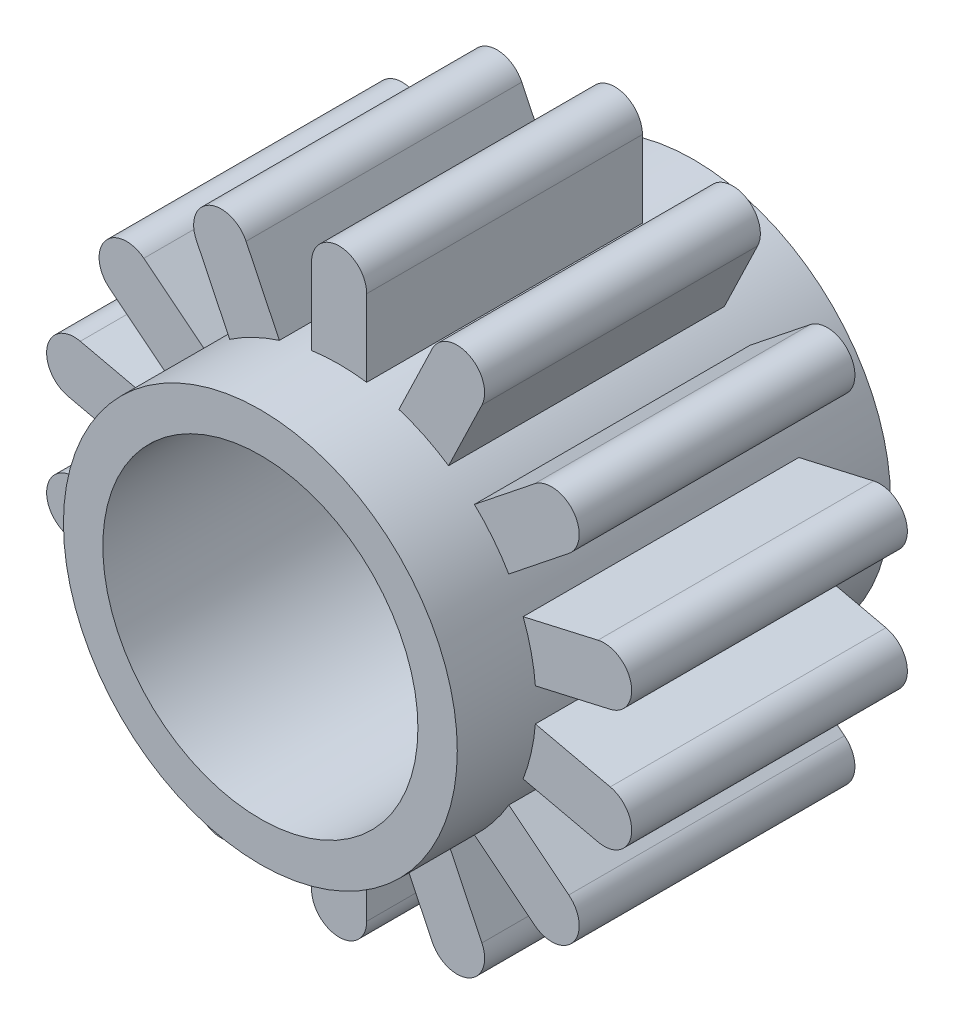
ISO-10303-21;
HEADER;
FILE_DESCRIPTION(('STEP AP214'),'2;1');
FILE_NAME('part.step','',(''),(''),'','','');
FILE_SCHEMA(('AUTOMOTIVE_DESIGN { 1 0 10303 214 1 1 1 1 }'));
ENDSEC;
DATA;
#1=APPLICATION_CONTEXT('core data for automotive mechanical design processes');
#2=APPLICATION_PROTOCOL_DEFINITION('international standard','automotive_design',2000,#1);
#3=PRODUCT_CONTEXT('',#1,'mechanical');
#4=PRODUCT('Part','Part','',(#3));
#5=PRODUCT_RELATED_PRODUCT_CATEGORY('part','',(#4));
#6=PRODUCT_DEFINITION_FORMATION('','',#4);
#7=PRODUCT_DEFINITION_CONTEXT('part definition',#1,'design');
#8=PRODUCT_DEFINITION('design','',#6,#7);
#9=PRODUCT_DEFINITION_SHAPE('','',#8);
#10=(LENGTH_UNIT() NAMED_UNIT(*) SI_UNIT(.MILLI.,.METRE.));
#11=(NAMED_UNIT(*) PLANE_ANGLE_UNIT() SI_UNIT($,.RADIAN.));
#12=(NAMED_UNIT(*) SI_UNIT($,.STERADIAN.) SOLID_ANGLE_UNIT());
#13=UNCERTAINTY_MEASURE_WITH_UNIT(LENGTH_MEASURE(1.E-05),#10,'distance_accuracy_value','');
#14=(GEOMETRIC_REPRESENTATION_CONTEXT(3) GLOBAL_UNCERTAINTY_ASSIGNED_CONTEXT((#13)) GLOBAL_UNIT_ASSIGNED_CONTEXT((#10,
#11,#12)) REPRESENTATION_CONTEXT('',''));
#15=CARTESIAN_POINT('',(0.,0.,0.));
#16=DIRECTION('',(0.,0.,1.));
#17=DIRECTION('',(1.,0.,0.));
#18=AXIS2_PLACEMENT_3D('',#15,#16,#17);
#19=CARTESIAN_POINT('',(0.,0.,2.75));
#20=DIRECTION('',(0.,0.,-1.));
#21=DIRECTION('',(-1.,0.,0.));
#22=AXIS2_PLACEMENT_3D('',#19,#20,#21);
#23=CYLINDRICAL_SURFACE('',#22,2.5);
#24=CARTESIAN_POINT('',(0.,0.,-1.75));
#25=DIRECTION('',(0.,0.,-1.));
#26=DIRECTION('',(1.,0.,0.));
#27=AXIS2_PLACEMENT_3D('',#24,#25,#26);
#28=CIRCLE('',#27,2.5);
#29=CARTESIAN_POINT('',(-2.1535504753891,1.26973239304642,-1.75));
#30=VERTEX_POINT('',#29);
#31=CARTESIAN_POINT('',(-1.71710761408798,1.81701443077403,-1.75));
#32=VERTEX_POINT('',#31);
#33=EDGE_CURVE('E427',#30,#32,#28,.T.);
#34=ORIENTED_EDGE('',*,*,#33,.T.);
#35=DIRECTION('',(0.,0.,1.));
#36=VECTOR('',#35,1.);
#37=CARTESIAN_POINT('',(-1.71710761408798,1.81701443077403,-1.75));
#38=LINE('',#37,#36);
#39=CARTESIAN_POINT('',(-1.71710761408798,1.81701443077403,1.75));
#40=VERTEX_POINT('',#39);
#41=EDGE_CURVE('E439',#32,#40,#38,.T.);
#42=ORIENTED_EDGE('',*,*,#41,.T.);
#43=CARTESIAN_POINT('',(0.,0.,1.75));
#44=DIRECTION('',(0.,0.,-1.));
#45=DIRECTION('',(1.,0.,0.));
#46=AXIS2_PLACEMENT_3D('',#43,#44,#45);
#47=CIRCLE('',#46,2.5);
#48=CARTESIAN_POINT('',(-2.1535504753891,1.26973239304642,1.75));
#49=VERTEX_POINT('',#48);
#50=EDGE_CURVE('E418',#49,#40,#47,.T.);
#51=ORIENTED_EDGE('',*,*,#50,.F.);
#52=DIRECTION('',(0.,0.,1.));
#53=VECTOR('',#52,1.);
#54=CARTESIAN_POINT('',(-2.1535504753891,1.26973239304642,-1.75));
#55=LINE('',#54,#53);
#56=EDGE_CURVE('E440',#30,#49,#55,.T.);
#57=ORIENTED_EDGE('',*,*,#56,.F.);
#58=EDGE_LOOP('',(#34,#42,#51,#57));
#59=FACE_BOUND('',#58,.T.);
#60=CARTESIAN_POINT('',(0.,0.,-1.75));
#61=DIRECTION('',(0.,0.,-1.));
#62=DIRECTION('',(1.,0.,0.));
#63=AXIS2_PLACEMENT_3D('',#60,#61,#62);
#64=CIRCLE('',#63,2.5);
#65=CARTESIAN_POINT('',(-2.33543351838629,-0.892048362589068,-1.75));
#66=VERTEX_POINT('',#65);
#67=CARTESIAN_POINT('',(-2.4911981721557,-0.20959882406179,-1.75));
#68=VERTEX_POINT('',#67);
#69=EDGE_CURVE('E492',#66,#68,#64,.T.);
#70=ORIENTED_EDGE('',*,*,#69,.T.);
#71=DIRECTION('',(0.,0.,1.));
#72=VECTOR('',#71,1.);
#73=CARTESIAN_POINT('',(-2.4911981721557,-0.20959882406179,-1.75));
#74=LINE('',#73,#72);
#75=CARTESIAN_POINT('',(-2.4911981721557,-0.20959882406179,1.75));
#76=VERTEX_POINT('',#75);
#77=EDGE_CURVE('E504',#68,#76,#74,.T.);
#78=ORIENTED_EDGE('',*,*,#77,.T.);
#79=CARTESIAN_POINT('',(0.,0.,1.75));
#80=DIRECTION('',(0.,0.,-1.));
#81=DIRECTION('',(1.,0.,0.));
#82=AXIS2_PLACEMENT_3D('',#79,#80,#81);
#83=CIRCLE('',#82,2.5);
#84=CARTESIAN_POINT('',(-2.33543351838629,-0.892048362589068,1.75));
#85=VERTEX_POINT('',#84);
#86=EDGE_CURVE('E475',#85,#76,#83,.T.);
#87=ORIENTED_EDGE('',*,*,#86,.F.);
#88=DIRECTION('',(0.,0.,1.));
#89=VECTOR('',#88,1.);
#90=CARTESIAN_POINT('',(-2.33543351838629,-0.892048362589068,-1.75));
#91=LINE('',#90,#89);
#92=EDGE_CURVE('E505',#66,#85,#91,.T.);
#93=ORIENTED_EDGE('',*,*,#92,.F.);
#94=EDGE_LOOP('',(#70,#78,#87,#93));
#95=FACE_BOUND('',#94,.T.);
#96=CARTESIAN_POINT('',(0.,0.,-1.75));
#97=DIRECTION('',(0.,0.,-1.));
#98=DIRECTION('',(1.,0.,0.));
#99=AXIS2_PLACEMENT_3D('',#96,#97,#98);
#100=CIRCLE('',#99,2.5);
#101=CARTESIAN_POINT('',(-0.758687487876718,-2.38209850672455,-1.75));
#102=VERTEX_POINT('',#101);
#103=CARTESIAN_POINT('',(-1.38936569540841,-2.07837988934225,-1.75));
#104=VERTEX_POINT('',#103);
#105=EDGE_CURVE('E558',#102,#104,#100,.T.);
#106=ORIENTED_EDGE('',*,*,#105,.T.);
#107=DIRECTION('',(0.,0.,1.));
#108=VECTOR('',#107,1.);
#109=CARTESIAN_POINT('',(-1.38936569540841,-2.07837988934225,-1.75));
#110=LINE('',#109,#108);
#111=CARTESIAN_POINT('',(-1.38936569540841,-2.07837988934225,1.75));
#112=VERTEX_POINT('',#111);
#113=EDGE_CURVE('E570',#104,#112,#110,.T.);
#114=ORIENTED_EDGE('',*,*,#113,.T.);
#115=CARTESIAN_POINT('',(0.,0.,1.75));
#116=DIRECTION('',(0.,0.,-1.));
#117=DIRECTION('',(1.,0.,0.));
#118=AXIS2_PLACEMENT_3D('',#115,#116,#117);
#119=CIRCLE('',#118,2.5);
#120=CARTESIAN_POINT('',(-0.758687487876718,-2.38209850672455,1.75));
#121=VERTEX_POINT('',#120);
#122=EDGE_CURVE('E541',#121,#112,#119,.T.);
#123=ORIENTED_EDGE('',*,*,#122,.F.);
#124=DIRECTION('',(0.,0.,1.));
#125=VECTOR('',#124,1.);
#126=CARTESIAN_POINT('',(-0.758687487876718,-2.38209850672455,-1.75));
#127=LINE('',#126,#125);
#128=EDGE_CURVE('E571',#102,#121,#127,.T.);
#129=ORIENTED_EDGE('',*,*,#128,.F.);
#130=EDGE_LOOP('',(#106,#114,#123,#129));
#131=FACE_BOUND('',#130,.T.);
#132=CARTESIAN_POINT('',(0.,0.,-1.75));
#133=DIRECTION('',(0.,0.,-1.));
#134=DIRECTION('',(1.,0.,0.));
#135=AXIS2_PLACEMENT_3D('',#132,#133,#134);
#136=CIRCLE('',#135,2.5);
#137=CARTESIAN_POINT('',(1.38936569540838,-2.07837988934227,-1.75));
#138=VERTEX_POINT('',#137);
#139=CARTESIAN_POINT('',(0.758687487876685,-2.38209850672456,-1.75));
#140=VERTEX_POINT('',#139);
#141=EDGE_CURVE('E624',#138,#140,#136,.T.);
#142=ORIENTED_EDGE('',*,*,#141,.T.);
#143=DIRECTION('',(0.,0.,1.));
#144=VECTOR('',#143,1.);
#145=CARTESIAN_POINT('',(0.758687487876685,-2.38209850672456,-1.75));
#146=LINE('',#145,#144);
#147=CARTESIAN_POINT('',(0.758687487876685,-2.38209850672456,1.75));
#148=VERTEX_POINT('',#147);
#149=EDGE_CURVE('E636',#140,#148,#146,.T.);
#150=ORIENTED_EDGE('',*,*,#149,.T.);
#151=CARTESIAN_POINT('',(0.,0.,1.75));
#152=DIRECTION('',(0.,0.,-1.));
#153=DIRECTION('',(1.,0.,0.));
#154=AXIS2_PLACEMENT_3D('',#151,#152,#153);
#155=CIRCLE('',#154,2.5);
#156=CARTESIAN_POINT('',(1.38936569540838,-2.07837988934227,1.75));
#157=VERTEX_POINT('',#156);
#158=EDGE_CURVE('E607',#157,#148,#155,.T.);
#159=ORIENTED_EDGE('',*,*,#158,.F.);
#160=DIRECTION('',(0.,0.,1.));
#161=VECTOR('',#160,1.);
#162=CARTESIAN_POINT('',(1.38936569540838,-2.07837988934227,-1.75));
#163=LINE('',#162,#161);
#164=EDGE_CURVE('E637',#138,#157,#163,.T.);
#165=ORIENTED_EDGE('',*,*,#164,.F.);
#166=EDGE_LOOP('',(#142,#150,#159,#165));
#167=FACE_BOUND('',#166,.T.);
#168=CARTESIAN_POINT('',(0.,0.,-1.75));
#169=DIRECTION('',(0.,0.,-1.));
#170=DIRECTION('',(1.,0.,0.));
#171=AXIS2_PLACEMENT_3D('',#168,#169,#170);
#172=CIRCLE('',#171,2.5);
#173=CARTESIAN_POINT('',(2.4911981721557,-0.209598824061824,-1.75));
#174=VERTEX_POINT('',#173);
#175=CARTESIAN_POINT('',(2.33543351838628,-0.8920483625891,-1.75));
#176=VERTEX_POINT('',#175);
#177=EDGE_CURVE('E690',#174,#176,#172,.T.);
#178=ORIENTED_EDGE('',*,*,#177,.T.);
#179=DIRECTION('',(0.,0.,1.));
#180=VECTOR('',#179,1.);
#181=CARTESIAN_POINT('',(2.33543351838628,-0.8920483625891,-1.75));
#182=LINE('',#181,#180);
#183=CARTESIAN_POINT('',(2.33543351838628,-0.8920483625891,1.75));
#184=VERTEX_POINT('',#183);
#185=EDGE_CURVE('E702',#176,#184,#182,.T.);
#186=ORIENTED_EDGE('',*,*,#185,.T.);
#187=CARTESIAN_POINT('',(0.,0.,1.75));
#188=DIRECTION('',(0.,0.,-1.));
#189=DIRECTION('',(1.,0.,0.));
#190=AXIS2_PLACEMENT_3D('',#187,#188,#189);
#191=CIRCLE('',#190,2.5);
#192=CARTESIAN_POINT('',(2.4911981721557,-0.209598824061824,1.75));
#193=VERTEX_POINT('',#192);
#194=EDGE_CURVE('E673',#193,#184,#191,.T.);
#195=ORIENTED_EDGE('',*,*,#194,.F.);
#196=DIRECTION('',(0.,0.,1.));
#197=VECTOR('',#196,1.);
#198=CARTESIAN_POINT('',(2.4911981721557,-0.209598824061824,-1.75));
#199=LINE('',#198,#197);
#200=EDGE_CURVE('E703',#174,#193,#199,.T.);
#201=ORIENTED_EDGE('',*,*,#200,.F.);
#202=EDGE_LOOP('',(#178,#186,#195,#201));
#203=FACE_BOUND('',#202,.T.);
#204=CARTESIAN_POINT('',(0.,0.,-1.75));
#205=DIRECTION('',(0.,0.,-1.));
#206=DIRECTION('',(1.,0.,0.));
#207=AXIS2_PLACEMENT_3D('',#204,#205,#206);
#208=CIRCLE('',#207,2.5);
#209=CARTESIAN_POINT('',(1.717107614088,1.81701443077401,-1.75));
#210=VERTEX_POINT('',#209);
#211=CARTESIAN_POINT('',(2.15355047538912,1.26973239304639,-1.75));
#212=VERTEX_POINT('',#211);
#213=EDGE_CURVE('E756',#210,#212,#208,.T.);
#214=ORIENTED_EDGE('',*,*,#213,.T.);
#215=DIRECTION('',(0.,0.,1.));
#216=VECTOR('',#215,1.);
#217=CARTESIAN_POINT('',(2.15355047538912,1.26973239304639,-1.75));
#218=LINE('',#217,#216);
#219=CARTESIAN_POINT('',(2.15355047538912,1.26973239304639,1.75));
#220=VERTEX_POINT('',#219);
#221=EDGE_CURVE('E768',#212,#220,#218,.T.);
#222=ORIENTED_EDGE('',*,*,#221,.T.);
#223=CARTESIAN_POINT('',(0.,0.,1.75));
#224=DIRECTION('',(0.,0.,-1.));
#225=DIRECTION('',(1.,0.,0.));
#226=AXIS2_PLACEMENT_3D('',#223,#224,#225);
#227=CIRCLE('',#226,2.5);
#228=CARTESIAN_POINT('',(1.717107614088,1.81701443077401,1.75));
#229=VERTEX_POINT('',#228);
#230=EDGE_CURVE('E739',#229,#220,#227,.T.);
#231=ORIENTED_EDGE('',*,*,#230,.F.);
#232=DIRECTION('',(0.,0.,1.));
#233=VECTOR('',#232,1.);
#234=CARTESIAN_POINT('',(1.717107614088,1.81701443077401,-1.75));
#235=LINE('',#234,#233);
#236=EDGE_CURVE('E769',#210,#229,#235,.T.);
#237=ORIENTED_EDGE('',*,*,#236,.F.);
#238=EDGE_LOOP('',(#214,#222,#231,#237));
#239=FACE_BOUND('',#238,.T.);
#240=CARTESIAN_POINT('',(0.,0.,-1.75));
#241=DIRECTION('',(0.,0.,-1.));
#242=DIRECTION('',(1.,0.,0.));
#243=AXIS2_PLACEMENT_3D('',#240,#241,#242);
#244=CIRCLE('',#243,2.5);
#245=CARTESIAN_POINT('',(-0.35,2.47537875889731,-1.75));
#246=VERTEX_POINT('',#245);
#247=CARTESIAN_POINT('',(0.35,2.47537875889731,-1.75));
#248=VERTEX_POINT('',#247);
#249=EDGE_CURVE('E822',#246,#248,#244,.T.);
#250=ORIENTED_EDGE('',*,*,#249,.T.);
#251=DIRECTION('',(0.,0.,1.));
#252=VECTOR('',#251,1.);
#253=CARTESIAN_POINT('',(0.35,2.47537875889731,-1.75));
#254=LINE('',#253,#252);
#255=CARTESIAN_POINT('',(0.35,2.47537875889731,1.75));
#256=VERTEX_POINT('',#255);
#257=EDGE_CURVE('E834',#248,#256,#254,.T.);
#258=ORIENTED_EDGE('',*,*,#257,.T.);
#259=CARTESIAN_POINT('',(0.,0.,1.75));
#260=DIRECTION('',(0.,0.,-1.));
#261=DIRECTION('',(1.,0.,0.));
#262=AXIS2_PLACEMENT_3D('',#259,#260,#261);
#263=CIRCLE('',#262,2.5);
#264=CARTESIAN_POINT('',(-0.35,2.47537875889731,1.75));
#265=VERTEX_POINT('',#264);
#266=EDGE_CURVE('E805',#265,#256,#263,.T.);
#267=ORIENTED_EDGE('',*,*,#266,.F.);
#268=DIRECTION('',(0.,0.,1.));
#269=VECTOR('',#268,1.);
#270=CARTESIAN_POINT('',(-0.35,2.47537875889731,-1.75));
#271=LINE('',#270,#269);
#272=EDGE_CURVE('E835',#246,#265,#271,.T.);
#273=ORIENTED_EDGE('',*,*,#272,.F.);
#274=EDGE_LOOP('',(#250,#258,#267,#273));
#275=FACE_BOUND('',#274,.T.);
#276=CARTESIAN_POINT('',(0.,0.,2.75));
#277=DIRECTION('',(0.,0.,1.));
#278=DIRECTION('',(1.,0.,0.));
#279=AXIS2_PLACEMENT_3D('',#276,#277,#278);
#280=CIRCLE('',#279,2.5);
#281=CARTESIAN_POINT('',(2.5,0.,2.75));
#282=VERTEX_POINT('',#281);
#283=EDGE_CURVE('E11',#282,#282,#280,.T.);
#284=ORIENTED_EDGE('',*,*,#283,.F.);
#285=EDGE_LOOP('',(#284));
#286=FACE_BOUND('',#285,.T.);
#287=CARTESIAN_POINT('',(0.,0.,-2.75));
#288=DIRECTION('',(0.,0.,1.));
#289=DIRECTION('',(1.,0.,0.));
#290=AXIS2_PLACEMENT_3D('',#287,#288,#289);
#291=CIRCLE('',#290,2.5);
#292=CARTESIAN_POINT('',(2.5,0.,-2.75));
#293=VERTEX_POINT('',#292);
#294=EDGE_CURVE('E847',#293,#293,#291,.T.);
#295=ORIENTED_EDGE('',*,*,#294,.T.);
#296=EDGE_LOOP('',(#295));
#297=FACE_BOUND('',#296,.T.);
#298=CARTESIAN_POINT('',(0.,0.,-1.75));
#299=DIRECTION('',(0.,0.,-1.));
#300=DIRECTION('',(1.,0.,0.));
#301=AXIS2_PLACEMENT_3D('',#298,#299,#300);
#302=CIRCLE('',#301,2.5);
#303=CARTESIAN_POINT('',(0.758687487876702,2.38209850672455,-1.75));
#304=VERTEX_POINT('',#303);
#305=CARTESIAN_POINT('',(1.3893656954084,2.07837988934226,-1.75));
#306=VERTEX_POINT('',#305);
#307=EDGE_CURVE('E789',#304,#306,#302,.T.);
#308=ORIENTED_EDGE('',*,*,#307,.T.);
#309=DIRECTION('',(0.,0.,1.));
#310=VECTOR('',#309,1.);
#311=CARTESIAN_POINT('',(1.3893656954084,2.07837988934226,-1.75));
#312=LINE('',#311,#310);
#313=CARTESIAN_POINT('',(1.3893656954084,2.07837988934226,1.75));
#314=VERTEX_POINT('',#313);
#315=EDGE_CURVE('E801',#306,#314,#312,.T.);
#316=ORIENTED_EDGE('',*,*,#315,.T.);
#317=CARTESIAN_POINT('',(0.,0.,1.75));
#318=DIRECTION('',(0.,0.,-1.));
#319=DIRECTION('',(1.,0.,0.));
#320=AXIS2_PLACEMENT_3D('',#317,#318,#319);
#321=CIRCLE('',#320,2.5);
#322=CARTESIAN_POINT('',(0.758687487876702,2.38209850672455,1.75));
#323=VERTEX_POINT('',#322);
#324=EDGE_CURVE('E772',#323,#314,#321,.T.);
#325=ORIENTED_EDGE('',*,*,#324,.F.);
#326=DIRECTION('',(0.,0.,1.));
#327=VECTOR('',#326,1.);
#328=CARTESIAN_POINT('',(0.758687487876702,2.38209850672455,-1.75));
#329=LINE('',#328,#327);
#330=EDGE_CURVE('E802',#304,#323,#329,.T.);
#331=ORIENTED_EDGE('',*,*,#330,.F.);
#332=EDGE_LOOP('',(#308,#316,#325,#331));
#333=FACE_BOUND('',#332,.T.);
#334=CARTESIAN_POINT('',(0.,0.,-1.75));
#335=DIRECTION('',(0.,0.,-1.));
#336=DIRECTION('',(1.,0.,0.));
#337=AXIS2_PLACEMENT_3D('',#334,#335,#336);
#338=CIRCLE('',#337,2.5);
#339=CARTESIAN_POINT('',(2.33543351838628,0.892048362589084,-1.75));
#340=VERTEX_POINT('',#339);
#341=CARTESIAN_POINT('',(2.4911981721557,0.209598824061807,-1.75));
#342=VERTEX_POINT('',#341);
#343=EDGE_CURVE('E723',#340,#342,#338,.T.);
#344=ORIENTED_EDGE('',*,*,#343,.T.);
#345=DIRECTION('',(0.,0.,1.));
#346=VECTOR('',#345,1.);
#347=CARTESIAN_POINT('',(2.4911981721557,0.209598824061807,-1.75));
#348=LINE('',#347,#346);
#349=CARTESIAN_POINT('',(2.4911981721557,0.209598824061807,1.75));
#350=VERTEX_POINT('',#349);
#351=EDGE_CURVE('E735',#342,#350,#348,.T.);
#352=ORIENTED_EDGE('',*,*,#351,.T.);
#353=CARTESIAN_POINT('',(0.,0.,1.75));
#354=DIRECTION('',(0.,0.,-1.));
#355=DIRECTION('',(1.,0.,0.));
#356=AXIS2_PLACEMENT_3D('',#353,#354,#355);
#357=CIRCLE('',#356,2.5);
#358=CARTESIAN_POINT('',(2.33543351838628,0.892048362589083,1.75));
#359=VERTEX_POINT('',#358);
#360=EDGE_CURVE('E706',#359,#350,#357,.T.);
#361=ORIENTED_EDGE('',*,*,#360,.F.);
#362=DIRECTION('',(0.,0.,1.));
#363=VECTOR('',#362,1.);
#364=CARTESIAN_POINT('',(2.33543351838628,0.892048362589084,-1.75));
#365=LINE('',#364,#363);
#366=EDGE_CURVE('E736',#340,#359,#365,.T.);
#367=ORIENTED_EDGE('',*,*,#366,.F.);
#368=EDGE_LOOP('',(#344,#352,#361,#367));
#369=FACE_BOUND('',#368,.T.);
#370=CARTESIAN_POINT('',(0.,0.,-1.75));
#371=DIRECTION('',(0.,0.,-1.));
#372=DIRECTION('',(1.,0.,0.));
#373=AXIS2_PLACEMENT_3D('',#370,#371,#372);
#374=CIRCLE('',#373,2.5);
#375=CARTESIAN_POINT('',(2.15355047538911,-1.2697323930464,-1.75));
#376=VERTEX_POINT('',#375);
#377=CARTESIAN_POINT('',(1.71710761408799,-1.81701443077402,-1.75));
#378=VERTEX_POINT('',#377);
#379=EDGE_CURVE('E657',#376,#378,#374,.T.);
#380=ORIENTED_EDGE('',*,*,#379,.T.);
#381=DIRECTION('',(0.,0.,1.));
#382=VECTOR('',#381,1.);
#383=CARTESIAN_POINT('',(1.71710761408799,-1.81701443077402,-1.75));
#384=LINE('',#383,#382);
#385=CARTESIAN_POINT('',(1.71710761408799,-1.81701443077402,1.75));
#386=VERTEX_POINT('',#385);
#387=EDGE_CURVE('E669',#378,#386,#384,.T.);
#388=ORIENTED_EDGE('',*,*,#387,.T.);
#389=CARTESIAN_POINT('',(0.,0.,1.75));
#390=DIRECTION('',(0.,0.,-1.));
#391=DIRECTION('',(1.,0.,0.));
#392=AXIS2_PLACEMENT_3D('',#389,#390,#391);
#393=CIRCLE('',#392,2.5);
#394=CARTESIAN_POINT('',(2.15355047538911,-1.2697323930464,1.75));
#395=VERTEX_POINT('',#394);
#396=EDGE_CURVE('E640',#395,#386,#393,.T.);
#397=ORIENTED_EDGE('',*,*,#396,.F.);
#398=DIRECTION('',(0.,0.,1.));
#399=VECTOR('',#398,1.);
#400=CARTESIAN_POINT('',(2.15355047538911,-1.2697323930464,-1.75));
#401=LINE('',#400,#399);
#402=EDGE_CURVE('E670',#376,#395,#401,.T.);
#403=ORIENTED_EDGE('',*,*,#402,.F.);
#404=EDGE_LOOP('',(#380,#388,#397,#403));
#405=FACE_BOUND('',#404,.T.);
#406=CARTESIAN_POINT('',(0.,0.,-1.75));
#407=DIRECTION('',(0.,0.,-1.));
#408=DIRECTION('',(1.,0.,0.));
#409=AXIS2_PLACEMENT_3D('',#406,#407,#408);
#410=CIRCLE('',#409,2.5);
#411=CARTESIAN_POINT('',(0.349999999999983,-2.47537875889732,-1.75));
#412=VERTEX_POINT('',#411);
#413=CARTESIAN_POINT('',(-0.350000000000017,-2.47537875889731,-1.75));
#414=VERTEX_POINT('',#413);
#415=EDGE_CURVE('E591',#412,#414,#410,.T.);
#416=ORIENTED_EDGE('',*,*,#415,.T.);
#417=DIRECTION('',(0.,0.,1.));
#418=VECTOR('',#417,1.);
#419=CARTESIAN_POINT('',(-0.350000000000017,-2.47537875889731,-1.75));
#420=LINE('',#419,#418);
#421=CARTESIAN_POINT('',(-0.350000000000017,-2.47537875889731,1.75));
#422=VERTEX_POINT('',#421);
#423=EDGE_CURVE('E603',#414,#422,#420,.T.);
#424=ORIENTED_EDGE('',*,*,#423,.T.);
#425=CARTESIAN_POINT('',(0.,0.,1.75));
#426=DIRECTION('',(0.,0.,-1.));
#427=DIRECTION('',(1.,0.,0.));
#428=AXIS2_PLACEMENT_3D('',#425,#426,#427);
#429=CIRCLE('',#428,2.5);
#430=CARTESIAN_POINT('',(0.349999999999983,-2.47537875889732,1.75));
#431=VERTEX_POINT('',#430);
#432=EDGE_CURVE('E574',#431,#422,#429,.T.);
#433=ORIENTED_EDGE('',*,*,#432,.F.);
#434=DIRECTION('',(0.,0.,1.));
#435=VECTOR('',#434,1.);
#436=CARTESIAN_POINT('',(0.349999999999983,-2.47537875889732,-1.75));
#437=LINE('',#436,#435);
#438=EDGE_CURVE('E604',#412,#431,#437,.T.);
#439=ORIENTED_EDGE('',*,*,#438,.F.);
#440=EDGE_LOOP('',(#416,#424,#433,#439));
#441=FACE_BOUND('',#440,.T.);
#442=CARTESIAN_POINT('',(0.,0.,-1.75));
#443=DIRECTION('',(0.,0.,-1.));
#444=DIRECTION('',(1.,0.,0.));
#445=AXIS2_PLACEMENT_3D('',#442,#443,#444);
#446=CIRCLE('',#445,2.5);
#447=CARTESIAN_POINT('',(-1.71710761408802,-1.817014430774,-1.75));
#448=VERTEX_POINT('',#447);
#449=CARTESIAN_POINT('',(-2.15355047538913,-1.26973239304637,-1.75));
#450=VERTEX_POINT('',#449);
#451=EDGE_CURVE('E525',#448,#450,#446,.T.);
#452=ORIENTED_EDGE('',*,*,#451,.T.);
#453=DIRECTION('',(0.,0.,1.));
#454=VECTOR('',#453,1.);
#455=CARTESIAN_POINT('',(-2.15355047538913,-1.26973239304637,-1.75));
#456=LINE('',#455,#454);
#457=CARTESIAN_POINT('',(-2.15355047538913,-1.26973239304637,1.75));
#458=VERTEX_POINT('',#457);
#459=EDGE_CURVE('E537',#450,#458,#456,.T.);
#460=ORIENTED_EDGE('',*,*,#459,.T.);
#461=CARTESIAN_POINT('',(0.,0.,1.75));
#462=DIRECTION('',(0.,0.,-1.));
#463=DIRECTION('',(1.,0.,0.));
#464=AXIS2_PLACEMENT_3D('',#461,#462,#463);
#465=CIRCLE('',#464,2.5);
#466=CARTESIAN_POINT('',(-1.71710761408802,-1.817014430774,1.75));
#467=VERTEX_POINT('',#466);
#468=EDGE_CURVE('E508',#467,#458,#465,.T.);
#469=ORIENTED_EDGE('',*,*,#468,.F.);
#470=DIRECTION('',(0.,0.,1.));
#471=VECTOR('',#470,1.);
#472=CARTESIAN_POINT('',(-1.71710761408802,-1.817014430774,-1.75));
#473=LINE('',#472,#471);
#474=EDGE_CURVE('E538',#448,#467,#473,.T.);
#475=ORIENTED_EDGE('',*,*,#474,.F.);
#476=EDGE_LOOP('',(#452,#460,#469,#475));
#477=FACE_BOUND('',#476,.T.);
#478=CARTESIAN_POINT('',(0.,0.,-1.75));
#479=DIRECTION('',(0.,0.,-1.));
#480=DIRECTION('',(1.,0.,0.));
#481=AXIS2_PLACEMENT_3D('',#478,#479,#480);
#482=CIRCLE('',#481,2.5);
#483=CARTESIAN_POINT('',(-2.4911981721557,0.20959882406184,-1.75));
#484=VERTEX_POINT('',#483);
#485=CARTESIAN_POINT('',(-2.33543351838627,0.892048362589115,-1.75));
#486=VERTEX_POINT('',#485);
#487=EDGE_CURVE('E459',#484,#486,#482,.T.);
#488=ORIENTED_EDGE('',*,*,#487,.T.);
#489=DIRECTION('',(0.,0.,1.));
#490=VECTOR('',#489,1.);
#491=CARTESIAN_POINT('',(-2.33543351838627,0.892048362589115,-1.75));
#492=LINE('',#491,#490);
#493=CARTESIAN_POINT('',(-2.33543351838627,0.892048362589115,1.75));
#494=VERTEX_POINT('',#493);
#495=EDGE_CURVE('E471',#486,#494,#492,.T.);
#496=ORIENTED_EDGE('',*,*,#495,.T.);
#497=CARTESIAN_POINT('',(0.,0.,1.75));
#498=DIRECTION('',(0.,0.,-1.));
#499=DIRECTION('',(1.,0.,0.));
#500=AXIS2_PLACEMENT_3D('',#497,#498,#499);
#501=CIRCLE('',#500,2.5);
#502=CARTESIAN_POINT('',(-2.4911981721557,0.20959882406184,1.75));
#503=VERTEX_POINT('',#502);
#504=EDGE_CURVE('E442',#503,#494,#501,.T.);
#505=ORIENTED_EDGE('',*,*,#504,.F.);
#506=DIRECTION('',(0.,0.,1.));
#507=VECTOR('',#506,1.);
#508=CARTESIAN_POINT('',(-2.4911981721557,0.20959882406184,-1.75));
#509=LINE('',#508,#507);
#510=EDGE_CURVE('E472',#484,#503,#509,.T.);
#511=ORIENTED_EDGE('',*,*,#510,.F.);
#512=EDGE_LOOP('',(#488,#496,#505,#511));
#513=FACE_BOUND('',#512,.T.);
#514=CARTESIAN_POINT('',(0.,0.,-1.75));
#515=DIRECTION('',(0.,0.,-1.));
#516=DIRECTION('',(1.,0.,0.));
#517=AXIS2_PLACEMENT_3D('',#514,#515,#516);
#518=CIRCLE('',#517,2.5);
#519=CARTESIAN_POINT('',(-1.38936569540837,2.07837988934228,-1.75));
#520=VERTEX_POINT('',#519);
#521=CARTESIAN_POINT('',(-0.758687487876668,2.38209850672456,-1.75));
#522=VERTEX_POINT('',#521);
#523=EDGE_CURVE('E408',#520,#522,#518,.T.);
#524=ORIENTED_EDGE('',*,*,#523,.T.);
#525=DIRECTION('',(0.,0.,1.));
#526=VECTOR('',#525,1.);
#527=CARTESIAN_POINT('',(-0.758687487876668,2.38209850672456,-1.75));
#528=LINE('',#527,#526);
#529=CARTESIAN_POINT('',(-0.758687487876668,2.38209850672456,1.75));
#530=VERTEX_POINT('',#529);
#531=EDGE_CURVE('E395',#522,#530,#528,.T.);
#532=ORIENTED_EDGE('',*,*,#531,.T.);
#533=CARTESIAN_POINT('',(0.,0.,1.75));
#534=DIRECTION('',(0.,0.,-1.));
#535=DIRECTION('',(1.,0.,0.));
#536=AXIS2_PLACEMENT_3D('',#533,#534,#535);
#537=CIRCLE('',#536,2.5);
#538=CARTESIAN_POINT('',(-1.38936569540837,2.07837988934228,1.75));
#539=VERTEX_POINT('',#538);
#540=EDGE_CURVE('E400',#539,#530,#537,.T.);
#541=ORIENTED_EDGE('',*,*,#540,.F.);
#542=DIRECTION('',(0.,0.,1.));
#543=VECTOR('',#542,1.);
#544=CARTESIAN_POINT('',(-1.38936569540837,2.07837988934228,-1.75));
#545=LINE('',#544,#543);
#546=EDGE_CURVE('E421',#520,#539,#545,.T.);
#547=ORIENTED_EDGE('',*,*,#546,.F.);
#548=EDGE_LOOP('',(#524,#532,#541,#547));
#549=FACE_BOUND('',#548,.T.);
#550=ADVANCED_FACE('F36',(#59,#95,#131,#167,#203,#239,#275,#286,#297,#333,#369,#405,#441,#477,
#513,#549),#23,.T.);
#551=CARTESIAN_POINT('',(0.,0.,2.75));
#552=DIRECTION('',(0.,0.,1.));
#553=DIRECTION('',(1.,0.,0.));
#554=AXIS2_PLACEMENT_3D('',#551,#552,#553);
#555=PLANE('',#554);
#556=ORIENTED_EDGE('',*,*,#283,.T.);
#557=EDGE_LOOP('',(#556));
#558=FACE_BOUND('',#557,.T.);
#559=CARTESIAN_POINT('',(0.,0.,2.75));
#560=DIRECTION('',(0.,0.,1.));
#561=DIRECTION('',(1.,0.,0.));
#562=AXIS2_PLACEMENT_3D('',#559,#560,#561);
#563=CIRCLE('',#562,2.);
#564=CARTESIAN_POINT('',(2.,0.,2.75));
#565=VERTEX_POINT('',#564);
#566=EDGE_CURVE('E43',#565,#565,#563,.T.);
#567=ORIENTED_EDGE('',*,*,#566,.F.);
#568=EDGE_LOOP('',(#567));
#569=FACE_BOUND('',#568,.T.);
#570=ADVANCED_FACE('F855',(#558,#569),#555,.T.);
#571=CARTESIAN_POINT('',(0.,0.,2.75));
#572=DIRECTION('',(0.,0.,-1.));
#573=DIRECTION('',(-1.,0.,0.));
#574=AXIS2_PLACEMENT_3D('',#571,#572,#573);
#575=CYLINDRICAL_SURFACE('',#574,2.);
#576=ORIENTED_EDGE('',*,*,#566,.T.);
#577=EDGE_LOOP('',(#576));
#578=FACE_BOUND('',#577,.T.);
#579=CARTESIAN_POINT('',(0.,0.,-2.75));
#580=DIRECTION('',(0.,0.,1.));
#581=DIRECTION('',(1.,0.,0.));
#582=AXIS2_PLACEMENT_3D('',#579,#580,#581);
#583=CIRCLE('',#582,2.);
#584=CARTESIAN_POINT('',(2.,0.,-2.75));
#585=VERTEX_POINT('',#584);
#586=EDGE_CURVE('E838',#585,#585,#583,.T.);
#587=ORIENTED_EDGE('',*,*,#586,.F.);
#588=EDGE_LOOP('',(#587));
#589=FACE_BOUND('',#588,.T.);
#590=ADVANCED_FACE('F852',(#578,#589),#575,.F.);
#591=CARTESIAN_POINT('',(0.,0.,-2.75));
#592=DIRECTION('',(0.,0.,1.));
#593=DIRECTION('',(1.,0.,0.));
#594=AXIS2_PLACEMENT_3D('',#591,#592,#593);
#595=PLANE('',#594);
#596=ORIENTED_EDGE('',*,*,#586,.T.);
#597=EDGE_LOOP('',(#596));
#598=FACE_BOUND('',#597,.T.);
#599=ORIENTED_EDGE('',*,*,#294,.F.);
#600=EDGE_LOOP('',(#599));
#601=FACE_BOUND('',#600,.T.);
#602=ADVANCED_FACE('F862',(#598,#601),#595,.F.);
#603=CARTESIAN_POINT('',(-0.35,2.47537875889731,-1.75));
#604=DIRECTION('',(-1.,0.,0.));
#605=DIRECTION('',(0.,-1.,0.));
#606=AXIS2_PLACEMENT_3D('',#603,#604,#605);
#607=PLANE('',#606);
#608=ORIENTED_EDGE('',*,*,#272,.T.);
#609=DIRECTION('',(0.,-1.,0.));
#610=VECTOR('',#609,1.);
#611=CARTESIAN_POINT('',(-0.35,2.47537875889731,1.75));
#612=LINE('',#611,#610);
#613=CARTESIAN_POINT('',(-0.349999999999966,3.45000000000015,1.75));
#614=VERTEX_POINT('',#613);
#615=EDGE_CURVE('E820',#614,#265,#612,.T.);
#616=ORIENTED_EDGE('',*,*,#615,.F.);
#617=DIRECTION('',(0.,0.,1.));
#618=VECTOR('',#617,1.);
#619=CARTESIAN_POINT('',(-0.349999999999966,3.45000000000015,-1.75));
#620=LINE('',#619,#618);
#621=CARTESIAN_POINT('',(-0.349999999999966,3.45000000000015,-1.75));
#622=VERTEX_POINT('',#621);
#623=EDGE_CURVE('E839',#622,#614,#620,.T.);
#624=ORIENTED_EDGE('',*,*,#623,.F.);
#625=DIRECTION('',(0.,-1.,0.));
#626=VECTOR('',#625,1.);
#627=CARTESIAN_POINT('',(-0.35,2.47537875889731,-1.75));
#628=LINE('',#627,#626);
#629=EDGE_CURVE('E831',#622,#246,#628,.T.);
#630=ORIENTED_EDGE('',*,*,#629,.T.);
#631=EDGE_LOOP('',(#608,#616,#624,#630));
#632=FACE_BOUND('',#631,.T.);
#633=ADVANCED_FACE('F868',(#632),#607,.T.);
#634=CARTESIAN_POINT('',(0.,3.45000000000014,-1.75));
#635=DIRECTION('',(0.,0.,1.));
#636=DIRECTION('',(1.,0.,0.));
#637=AXIS2_PLACEMENT_3D('',#634,#635,#636);
#638=CYLINDRICAL_SURFACE('',#637,0.35);
#639=ORIENTED_EDGE('',*,*,#623,.T.);
#640=CARTESIAN_POINT('',(0.,3.45000000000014,1.75));
#641=DIRECTION('',(0.,0.,1.));
#642=DIRECTION('',(1.,0.,0.));
#643=AXIS2_PLACEMENT_3D('',#640,#641,#642);
#644=CIRCLE('',#643,0.35);
#645=CARTESIAN_POINT('',(0.350000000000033,3.45000000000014,1.75));
#646=VERTEX_POINT('',#645);
#647=EDGE_CURVE('E817',#646,#614,#644,.T.);
#648=ORIENTED_EDGE('',*,*,#647,.F.);
#649=DIRECTION('',(0.,0.,1.));
#650=VECTOR('',#649,1.);
#651=CARTESIAN_POINT('',(0.350000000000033,3.45000000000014,-1.75));
#652=LINE('',#651,#650);
#653=CARTESIAN_POINT('',(0.350000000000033,3.45000000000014,-1.75));
#654=VERTEX_POINT('',#653);
#655=EDGE_CURVE('E841',#654,#646,#652,.T.);
#656=ORIENTED_EDGE('',*,*,#655,.F.);
#657=CARTESIAN_POINT('',(0.,3.45000000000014,-1.75));
#658=DIRECTION('',(0.,0.,1.));
#659=DIRECTION('',(1.,0.,0.));
#660=AXIS2_PLACEMENT_3D('',#657,#658,#659);
#661=CIRCLE('',#660,0.35);
#662=EDGE_CURVE('E828',#654,#622,#661,.T.);
#663=ORIENTED_EDGE('',*,*,#662,.T.);
#664=EDGE_LOOP('',(#639,#648,#656,#663));
#665=FACE_BOUND('',#664,.T.);
#666=ADVANCED_FACE('F874',(#665),#638,.T.);
#667=CARTESIAN_POINT('',(0.35,2.47537875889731,-1.75));
#668=DIRECTION('',(1.,0.,0.));
#669=DIRECTION('',(0.,1.,0.));
#670=AXIS2_PLACEMENT_3D('',#667,#668,#669);
#671=PLANE('',#670);
#672=ORIENTED_EDGE('',*,*,#655,.T.);
#673=DIRECTION('',(0.,1.,0.));
#674=VECTOR('',#673,1.);
#675=CARTESIAN_POINT('',(0.35,2.47537875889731,1.75));
#676=LINE('',#675,#674);
#677=EDGE_CURVE('E814',#256,#646,#676,.T.);
#678=ORIENTED_EDGE('',*,*,#677,.F.);
#679=ORIENTED_EDGE('',*,*,#257,.F.);
#680=DIRECTION('',(0.,1.,0.));
#681=VECTOR('',#680,1.);
#682=CARTESIAN_POINT('',(0.35,2.47537875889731,-1.75));
#683=LINE('',#682,#681);
#684=EDGE_CURVE('E825',#248,#654,#683,.T.);
#685=ORIENTED_EDGE('',*,*,#684,.T.);
#686=EDGE_LOOP('',(#672,#678,#679,#685));
#687=FACE_BOUND('',#686,.T.);
#688=ADVANCED_FACE('F870',(#687),#671,.T.);
#689=CARTESIAN_POINT('',(0.,0.,-1.75));
#690=DIRECTION('',(0.,0.,1.));
#691=DIRECTION('',(1.,0.,0.));
#692=AXIS2_PLACEMENT_3D('',#689,#690,#691);
#693=PLANE('',#692);
#694=ORIENTED_EDGE('',*,*,#249,.F.);
#695=ORIENTED_EDGE('',*,*,#629,.F.);
#696=ORIENTED_EDGE('',*,*,#662,.F.);
#697=ORIENTED_EDGE('',*,*,#684,.F.);
#698=EDGE_LOOP('',(#694,#695,#696,#697));
#699=FACE_BOUND('',#698,.T.);
#700=ADVANCED_FACE('F873',(#699),#693,.F.);
#701=CARTESIAN_POINT('',(0.,0.,1.75));
#702=DIRECTION('',(0.,0.,1.));
#703=DIRECTION('',(1.,0.,0.));
#704=AXIS2_PLACEMENT_3D('',#701,#702,#703);
#705=PLANE('',#704);
#706=ORIENTED_EDGE('',*,*,#266,.T.);
#707=ORIENTED_EDGE('',*,*,#677,.T.);
#708=ORIENTED_EDGE('',*,*,#647,.T.);
#709=ORIENTED_EDGE('',*,*,#615,.T.);
#710=EDGE_LOOP('',(#706,#707,#708,#709));
#711=FACE_BOUND('',#710,.T.);
#712=ADVANCED_FACE('F884',(#711),#705,.T.);
#713=CARTESIAN_POINT('',(0.758687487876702,2.38209850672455,-1.75));
#714=DIRECTION('',(-0.900968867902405,0.433883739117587,0.));
#715=DIRECTION('',(-0.433883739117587,-0.900968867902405,0.));
#716=AXIS2_PLACEMENT_3D('',#713,#714,#715);
#717=PLANE('',#716);
#718=ORIENTED_EDGE('',*,*,#330,.T.);
#719=DIRECTION('',(-0.433883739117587,-0.900968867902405,0.));
#720=VECTOR('',#719,1.);
#721=CARTESIAN_POINT('',(0.758687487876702,2.38209850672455,1.75));
#722=LINE('',#721,#720);
#723=CARTESIAN_POINT('',(1.18155979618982,3.26020190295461,1.75));
#724=VERTEX_POINT('',#723);
#725=EDGE_CURVE('E787',#724,#323,#722,.T.);
#726=ORIENTED_EDGE('',*,*,#725,.F.);
#727=DIRECTION('',(0.,0.,1.));
#728=VECTOR('',#727,1.);
#729=CARTESIAN_POINT('',(1.18155979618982,3.26020190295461,-1.75));
#730=LINE('',#729,#728);
#731=CARTESIAN_POINT('',(1.18155979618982,3.26020190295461,-1.75));
#732=VERTEX_POINT('',#731);
#733=EDGE_CURVE('E806',#732,#724,#730,.T.);
#734=ORIENTED_EDGE('',*,*,#733,.F.);
#735=DIRECTION('',(-0.433883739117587,-0.900968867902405,0.));
#736=VECTOR('',#735,1.);
#737=CARTESIAN_POINT('',(0.758687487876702,2.38209850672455,-1.75));
#738=LINE('',#737,#736);
#739=EDGE_CURVE('E798',#732,#304,#738,.T.);
#740=ORIENTED_EDGE('',*,*,#739,.T.);
#741=EDGE_LOOP('',(#718,#726,#734,#740));
#742=FACE_BOUND('',#741,.T.);
#743=ADVANCED_FACE('F888',(#742),#717,.T.);
#744=CARTESIAN_POINT('',(1.49689889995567,3.10834259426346,-1.75));
#745=DIRECTION('',(0.,0.,1.));
#746=DIRECTION('',(1.,0.,0.));
#747=AXIS2_PLACEMENT_3D('',#744,#745,#746);
#748=CYLINDRICAL_SURFACE('',#747,0.35);
#749=ORIENTED_EDGE('',*,*,#733,.T.);
#750=CARTESIAN_POINT('',(1.49689889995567,3.10834259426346,1.75));
#751=DIRECTION('',(0.,0.,1.));
#752=DIRECTION('',(1.,0.,0.));
#753=AXIS2_PLACEMENT_3D('',#750,#751,#752);
#754=CIRCLE('',#753,0.35);
#755=CARTESIAN_POINT('',(1.81223800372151,2.95648328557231,1.75));
#756=VERTEX_POINT('',#755);
#757=EDGE_CURVE('E784',#756,#724,#754,.T.);
#758=ORIENTED_EDGE('',*,*,#757,.F.);
#759=DIRECTION('',(0.,0.,1.));
#760=VECTOR('',#759,1.);
#761=CARTESIAN_POINT('',(1.81223800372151,2.95648328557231,-1.75));
#762=LINE('',#761,#760);
#763=CARTESIAN_POINT('',(1.81223800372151,2.95648328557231,-1.75));
#764=VERTEX_POINT('',#763);
#765=EDGE_CURVE('E808',#764,#756,#762,.T.);
#766=ORIENTED_EDGE('',*,*,#765,.F.);
#767=CARTESIAN_POINT('',(1.49689889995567,3.10834259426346,-1.75));
#768=DIRECTION('',(0.,0.,1.));
#769=DIRECTION('',(1.,0.,0.));
#770=AXIS2_PLACEMENT_3D('',#767,#768,#769);
#771=CIRCLE('',#770,0.35);
#772=EDGE_CURVE('E795',#764,#732,#771,.T.);
#773=ORIENTED_EDGE('',*,*,#772,.T.);
#774=EDGE_LOOP('',(#749,#758,#766,#773));
#775=FACE_BOUND('',#774,.T.);
#776=ADVANCED_FACE('F894',(#775),#748,.T.);
#777=CARTESIAN_POINT('',(1.3893656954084,2.07837988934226,-1.75));
#778=DIRECTION('',(0.900968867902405,-0.433883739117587,0.));
#779=DIRECTION('',(0.433883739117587,0.900968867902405,0.));
#780=AXIS2_PLACEMENT_3D('',#777,#778,#779);
#781=PLANE('',#780);
#782=ORIENTED_EDGE('',*,*,#765,.T.);
#783=DIRECTION('',(0.433883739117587,0.900968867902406,0.));
#784=VECTOR('',#783,1.);
#785=CARTESIAN_POINT('',(1.3893656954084,2.07837988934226,1.75));
#786=LINE('',#785,#784);
#787=EDGE_CURVE('E781',#314,#756,#786,.T.);
#788=ORIENTED_EDGE('',*,*,#787,.F.);
#789=ORIENTED_EDGE('',*,*,#315,.F.);
#790=DIRECTION('',(0.433883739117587,0.900968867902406,0.));
#791=VECTOR('',#790,1.);
#792=CARTESIAN_POINT('',(1.3893656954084,2.07837988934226,-1.75));
#793=LINE('',#792,#791);
#794=EDGE_CURVE('E792',#306,#764,#793,.T.);
#795=ORIENTED_EDGE('',*,*,#794,.T.);
#796=EDGE_LOOP('',(#782,#788,#789,#795));
#797=FACE_BOUND('',#796,.T.);
#798=ADVANCED_FACE('F890',(#797),#781,.T.);
#799=CARTESIAN_POINT('',(0.,0.,-1.75));
#800=DIRECTION('',(0.,0.,1.));
#801=DIRECTION('',(1.,0.,0.));
#802=AXIS2_PLACEMENT_3D('',#799,#800,#801);
#803=PLANE('',#802);
#804=ORIENTED_EDGE('',*,*,#307,.F.);
#805=ORIENTED_EDGE('',*,*,#739,.F.);
#806=ORIENTED_EDGE('',*,*,#772,.F.);
#807=ORIENTED_EDGE('',*,*,#794,.F.);
#808=EDGE_LOOP('',(#804,#805,#806,#807));
#809=FACE_BOUND('',#808,.T.);
#810=ADVANCED_FACE('F893',(#809),#803,.F.);
#811=CARTESIAN_POINT('',(0.,0.,1.75));
#812=DIRECTION('',(0.,0.,1.));
#813=DIRECTION('',(1.,0.,0.));
#814=AXIS2_PLACEMENT_3D('',#811,#812,#813);
#815=PLANE('',#814);
#816=ORIENTED_EDGE('',*,*,#324,.T.);
#817=ORIENTED_EDGE('',*,*,#787,.T.);
#818=ORIENTED_EDGE('',*,*,#757,.T.);
#819=ORIENTED_EDGE('',*,*,#725,.T.);
#820=EDGE_LOOP('',(#816,#817,#818,#819));
#821=FACE_BOUND('',#820,.T.);
#822=ADVANCED_FACE('F904',(#821),#815,.T.);
#823=CARTESIAN_POINT('',(1.717107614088,1.81701443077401,-1.75));
#824=DIRECTION('',(-0.62348980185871,0.781831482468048,0.));
#825=DIRECTION('',(-0.781831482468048,-0.623489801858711,0.));
#826=AXIS2_PLACEMENT_3D('',#823,#824,#825);
#827=PLANE('',#826);
#828=ORIENTED_EDGE('',*,*,#236,.T.);
#829=DIRECTION('',(-0.781831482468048,-0.62348980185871,0.));
#830=VECTOR('',#829,1.);
#831=CARTESIAN_POINT('',(1.717107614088,1.81701443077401,1.75));
#832=LINE('',#831,#830);
#833=CARTESIAN_POINT('',(2.47909718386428,2.42468083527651,1.75));
#834=VERTEX_POINT('',#833);
#835=EDGE_CURVE('E754',#834,#229,#832,.T.);
#836=ORIENTED_EDGE('',*,*,#835,.F.);
#837=DIRECTION('',(0.,0.,1.));
#838=VECTOR('',#837,1.);
#839=CARTESIAN_POINT('',(2.47909718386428,2.42468083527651,-1.75));
#840=LINE('',#839,#838);
#841=CARTESIAN_POINT('',(2.47909718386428,2.42468083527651,-1.75));
#842=VERTEX_POINT('',#841);
#843=EDGE_CURVE('E773',#842,#834,#840,.T.);
#844=ORIENTED_EDGE('',*,*,#843,.F.);
#845=DIRECTION('',(-0.781831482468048,-0.62348980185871,0.));
#846=VECTOR('',#845,1.);
#847=CARTESIAN_POINT('',(1.717107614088,1.81701443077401,-1.75));
#848=LINE('',#847,#846);
#849=EDGE_CURVE('E765',#842,#210,#848,.T.);
#850=ORIENTED_EDGE('',*,*,#849,.T.);
#851=EDGE_LOOP('',(#828,#836,#844,#850));
#852=FACE_BOUND('',#851,.T.);
#853=ADVANCED_FACE('F908',(#852),#827,.T.);
#854=CARTESIAN_POINT('',(2.69731861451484,2.15103981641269,-1.75));
#855=DIRECTION('',(0.,0.,1.));
#856=DIRECTION('',(1.,0.,0.));
#857=AXIS2_PLACEMENT_3D('',#854,#855,#856);
#858=CYLINDRICAL_SURFACE('',#857,0.35);
#859=ORIENTED_EDGE('',*,*,#843,.T.);
#860=CARTESIAN_POINT('',(2.69731861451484,2.15103981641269,1.75));
#861=DIRECTION('',(0.,0.,1.));
#862=DIRECTION('',(1.,0.,0.));
#863=AXIS2_PLACEMENT_3D('',#860,#861,#862);
#864=CIRCLE('',#863,0.35);
#865=CARTESIAN_POINT('',(2.91554004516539,1.87739879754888,1.75));
#866=VERTEX_POINT('',#865);
#867=EDGE_CURVE('E751',#866,#834,#864,.T.);
#868=ORIENTED_EDGE('',*,*,#867,.F.);
#869=DIRECTION('',(0.,0.,1.));
#870=VECTOR('',#869,1.);
#871=CARTESIAN_POINT('',(2.91554004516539,1.87739879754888,-1.75));
#872=LINE('',#871,#870);
#873=CARTESIAN_POINT('',(2.91554004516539,1.87739879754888,-1.75));
#874=VERTEX_POINT('',#873);
#875=EDGE_CURVE('E775',#874,#866,#872,.T.);
#876=ORIENTED_EDGE('',*,*,#875,.F.);
#877=CARTESIAN_POINT('',(2.69731861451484,2.15103981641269,-1.75));
#878=DIRECTION('',(0.,0.,1.));
#879=DIRECTION('',(1.,0.,0.));
#880=AXIS2_PLACEMENT_3D('',#877,#878,#879);
#881=CIRCLE('',#880,0.35);
#882=EDGE_CURVE('E762',#874,#842,#881,.T.);
#883=ORIENTED_EDGE('',*,*,#882,.T.);
#884=EDGE_LOOP('',(#859,#868,#876,#883));
#885=FACE_BOUND('',#884,.T.);
#886=ADVANCED_FACE('F914',(#885),#858,.T.);
#887=CARTESIAN_POINT('',(2.15355047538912,1.26973239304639,-1.75));
#888=DIRECTION('',(0.623489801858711,-0.781831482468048,0.));
#889=DIRECTION('',(0.781831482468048,0.623489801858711,0.));
#890=AXIS2_PLACEMENT_3D('',#887,#888,#889);
#891=PLANE('',#890);
#892=ORIENTED_EDGE('',*,*,#875,.T.);
#893=DIRECTION('',(0.781831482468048,0.623489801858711,0.));
#894=VECTOR('',#893,1.);
#895=CARTESIAN_POINT('',(2.15355047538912,1.26973239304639,1.75));
#896=LINE('',#895,#894);
#897=EDGE_CURVE('E748',#220,#866,#896,.T.);
#898=ORIENTED_EDGE('',*,*,#897,.F.);
#899=ORIENTED_EDGE('',*,*,#221,.F.);
#900=DIRECTION('',(0.781831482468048,0.623489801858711,0.));
#901=VECTOR('',#900,1.);
#902=CARTESIAN_POINT('',(2.15355047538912,1.26973239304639,-1.75));
#903=LINE('',#902,#901);
#904=EDGE_CURVE('E759',#212,#874,#903,.T.);
#905=ORIENTED_EDGE('',*,*,#904,.T.);
#906=EDGE_LOOP('',(#892,#898,#899,#905));
#907=FACE_BOUND('',#906,.T.);
#908=ADVANCED_FACE('F910',(#907),#891,.T.);
#909=CARTESIAN_POINT('',(0.,0.,-1.75));
#910=DIRECTION('',(0.,0.,1.));
#911=DIRECTION('',(1.,0.,0.));
#912=AXIS2_PLACEMENT_3D('',#909,#910,#911);
#913=PLANE('',#912);
#914=ORIENTED_EDGE('',*,*,#213,.F.);
#915=ORIENTED_EDGE('',*,*,#849,.F.);
#916=ORIENTED_EDGE('',*,*,#882,.F.);
#917=ORIENTED_EDGE('',*,*,#904,.F.);
#918=EDGE_LOOP('',(#914,#915,#916,#917));
#919=FACE_BOUND('',#918,.T.);
#920=ADVANCED_FACE('F913',(#919),#913,.F.);
#921=CARTESIAN_POINT('',(0.,0.,1.75));
#922=DIRECTION('',(0.,0.,1.));
#923=DIRECTION('',(1.,0.,0.));
#924=AXIS2_PLACEMENT_3D('',#921,#922,#923);
#925=PLANE('',#924);
#926=ORIENTED_EDGE('',*,*,#230,.T.);
#927=ORIENTED_EDGE('',*,*,#897,.T.);
#928=ORIENTED_EDGE('',*,*,#867,.T.);
#929=ORIENTED_EDGE('',*,*,#835,.T.);
#930=EDGE_LOOP('',(#926,#927,#928,#929));
#931=FACE_BOUND('',#930,.T.);
#932=ADVANCED_FACE('F924',(#931),#925,.T.);
#933=CARTESIAN_POINT('',(2.33543351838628,0.892048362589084,-1.75));
#934=DIRECTION('',(-0.222520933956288,0.974927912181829,0.));
#935=DIRECTION('',(-0.97492791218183,-0.222520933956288,0.));
#936=AXIS2_PLACEMENT_3D('',#933,#934,#935);
#937=PLANE('',#936);
#938=ORIENTED_EDGE('',*,*,#366,.T.);
#939=DIRECTION('',(-0.974927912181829,-0.222520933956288,0.));
#940=VECTOR('',#939,1.);
#941=CARTESIAN_POINT('',(2.33543351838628,0.892048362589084,1.75));
#942=LINE('',#941,#940);
#943=CARTESIAN_POINT('',(3.28561897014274,1.10892199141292,1.75));
#944=VERTEX_POINT('',#943);
#945=EDGE_CURVE('E721',#944,#359,#942,.T.);
#946=ORIENTED_EDGE('',*,*,#945,.F.);
#947=DIRECTION('',(0.,0.,1.));
#948=VECTOR('',#947,1.);
#949=CARTESIAN_POINT('',(3.28561897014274,1.10892199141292,-1.75));
#950=LINE('',#949,#948);
#951=CARTESIAN_POINT('',(3.28561897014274,1.10892199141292,-1.75));
#952=VERTEX_POINT('',#951);
#953=EDGE_CURVE('E740',#952,#944,#950,.T.);
#954=ORIENTED_EDGE('',*,*,#953,.F.);
#955=DIRECTION('',(-0.974927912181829,-0.222520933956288,0.));
#956=VECTOR('',#955,1.);
#957=CARTESIAN_POINT('',(2.33543351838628,0.892048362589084,-1.75));
#958=LINE('',#957,#956);
#959=EDGE_CURVE('E732',#952,#340,#958,.T.);
#960=ORIENTED_EDGE('',*,*,#959,.T.);
#961=EDGE_LOOP('',(#938,#946,#954,#960));
#962=FACE_BOUND('',#961,.T.);
#963=ADVANCED_FACE('F928',(#962),#937,.T.);
#964=CARTESIAN_POINT('',(3.36350129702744,0.767697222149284,-1.75));
#965=DIRECTION('',(0.,0.,1.));
#966=DIRECTION('',(1.,0.,0.));
#967=AXIS2_PLACEMENT_3D('',#964,#965,#966);
#968=CYLINDRICAL_SURFACE('',#967,0.35);
#969=ORIENTED_EDGE('',*,*,#953,.T.);
#970=CARTESIAN_POINT('',(3.36350129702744,0.767697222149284,1.75));
#971=DIRECTION('',(0.,0.,1.));
#972=DIRECTION('',(1.,0.,0.));
#973=AXIS2_PLACEMENT_3D('',#970,#971,#972);
#974=CIRCLE('',#973,0.35);
#975=CARTESIAN_POINT('',(3.44138362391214,0.426472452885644,1.75));
#976=VERTEX_POINT('',#975);
#977=EDGE_CURVE('E718',#976,#944,#974,.T.);
#978=ORIENTED_EDGE('',*,*,#977,.F.);
#979=DIRECTION('',(0.,0.,1.));
#980=VECTOR('',#979,1.);
#981=CARTESIAN_POINT('',(3.44138362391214,0.426472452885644,-1.75));
#982=LINE('',#981,#980);
#983=CARTESIAN_POINT('',(3.44138362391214,0.426472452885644,-1.75));
#984=VERTEX_POINT('',#983);
#985=EDGE_CURVE('E742',#984,#976,#982,.T.);
#986=ORIENTED_EDGE('',*,*,#985,.F.);
#987=CARTESIAN_POINT('',(3.36350129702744,0.767697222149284,-1.75));
#988=DIRECTION('',(0.,0.,1.));
#989=DIRECTION('',(1.,0.,0.));
#990=AXIS2_PLACEMENT_3D('',#987,#988,#989);
#991=CIRCLE('',#990,0.35);
#992=EDGE_CURVE('E729',#984,#952,#991,.T.);
#993=ORIENTED_EDGE('',*,*,#992,.T.);
#994=EDGE_LOOP('',(#969,#978,#986,#993));
#995=FACE_BOUND('',#994,.T.);
#996=ADVANCED_FACE('F934',(#995),#968,.T.);
#997=CARTESIAN_POINT('',(2.4911981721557,0.209598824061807,-1.75));
#998=DIRECTION('',(0.222520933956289,-0.974927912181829,0.));
#999=DIRECTION('',(0.974927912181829,0.222520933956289,0.));
#1000=AXIS2_PLACEMENT_3D('',#997,#998,#999);
#1001=PLANE('',#1000);
#1002=ORIENTED_EDGE('',*,*,#985,.T.);
#1003=DIRECTION('',(0.97492791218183,0.222520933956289,0.));
#1004=VECTOR('',#1003,1.);
#1005=CARTESIAN_POINT('',(2.4911981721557,0.209598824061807,1.75));
#1006=LINE('',#1005,#1004);
#1007=EDGE_CURVE('E715',#350,#976,#1006,.T.);
#1008=ORIENTED_EDGE('',*,*,#1007,.F.);
#1009=ORIENTED_EDGE('',*,*,#351,.F.);
#1010=DIRECTION('',(0.97492791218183,0.222520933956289,0.));
#1011=VECTOR('',#1010,1.);
#1012=CARTESIAN_POINT('',(2.4911981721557,0.209598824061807,-1.75));
#1013=LINE('',#1012,#1011);
#1014=EDGE_CURVE('E726',#342,#984,#1013,.T.);
#1015=ORIENTED_EDGE('',*,*,#1014,.T.);
#1016=EDGE_LOOP('',(#1002,#1008,#1009,#1015));
#1017=FACE_BOUND('',#1016,.T.);
#1018=ADVANCED_FACE('F930',(#1017),#1001,.T.);
#1019=CARTESIAN_POINT('',(0.,0.,-1.75));
#1020=DIRECTION('',(0.,0.,1.));
#1021=DIRECTION('',(1.,0.,0.));
#1022=AXIS2_PLACEMENT_3D('',#1019,#1020,#1021);
#1023=PLANE('',#1022);
#1024=ORIENTED_EDGE('',*,*,#343,.F.);
#1025=ORIENTED_EDGE('',*,*,#959,.F.);
#1026=ORIENTED_EDGE('',*,*,#992,.F.);
#1027=ORIENTED_EDGE('',*,*,#1014,.F.);
#1028=EDGE_LOOP('',(#1024,#1025,#1026,#1027));
#1029=FACE_BOUND('',#1028,.T.);
#1030=ADVANCED_FACE('F933',(#1029),#1023,.F.);
#1031=CARTESIAN_POINT('',(0.,0.,1.75));
#1032=DIRECTION('',(0.,0.,1.));
#1033=DIRECTION('',(1.,0.,0.));
#1034=AXIS2_PLACEMENT_3D('',#1031,#1032,#1033);
#1035=PLANE('',#1034);
#1036=ORIENTED_EDGE('',*,*,#360,.T.);
#1037=ORIENTED_EDGE('',*,*,#1007,.T.);
#1038=ORIENTED_EDGE('',*,*,#977,.T.);
#1039=ORIENTED_EDGE('',*,*,#945,.T.);
#1040=EDGE_LOOP('',(#1036,#1037,#1038,#1039));
#1041=FACE_BOUND('',#1040,.T.);
#1042=ADVANCED_FACE('F944',(#1041),#1035,.T.);
#1043=CARTESIAN_POINT('',(2.4911981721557,-0.209598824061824,-1.75));
#1044=DIRECTION('',(0.222520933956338,0.974927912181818,0.));
#1045=DIRECTION('',(-0.974927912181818,0.222520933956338,0.));
#1046=AXIS2_PLACEMENT_3D('',#1043,#1044,#1045);
#1047=PLANE('',#1046);
#1048=ORIENTED_EDGE('',*,*,#200,.T.);
#1049=DIRECTION('',(-0.974927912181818,0.222520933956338,0.));
#1050=VECTOR('',#1049,1.);
#1051=CARTESIAN_POINT('',(2.4911981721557,-0.209598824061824,1.75));
#1052=LINE('',#1051,#1050);
#1053=CARTESIAN_POINT('',(3.44138362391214,-0.426472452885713,1.75));
#1054=VERTEX_POINT('',#1053);
#1055=EDGE_CURVE('E688',#1054,#193,#1052,.T.);
#1056=ORIENTED_EDGE('',*,*,#1055,.F.);
#1057=DIRECTION('',(0.,0.,1.));
#1058=VECTOR('',#1057,1.);
#1059=CARTESIAN_POINT('',(3.44138362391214,-0.426472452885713,-1.75));
#1060=LINE('',#1059,#1058);
#1061=CARTESIAN_POINT('',(3.44138362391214,-0.426472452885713,-1.75));
#1062=VERTEX_POINT('',#1061);
#1063=EDGE_CURVE('E707',#1062,#1054,#1060,.T.);
#1064=ORIENTED_EDGE('',*,*,#1063,.F.);
#1065=DIRECTION('',(-0.974927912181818,0.222520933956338,0.));
#1066=VECTOR('',#1065,1.);
#1067=CARTESIAN_POINT('',(2.4911981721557,-0.209598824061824,-1.75));
#1068=LINE('',#1067,#1066);
#1069=EDGE_CURVE('E699',#1062,#174,#1068,.T.);
#1070=ORIENTED_EDGE('',*,*,#1069,.T.);
#1071=EDGE_LOOP('',(#1048,#1056,#1064,#1070));
#1072=FACE_BOUND('',#1071,.T.);
#1073=ADVANCED_FACE('F948',(#1072),#1047,.T.);
#1074=CARTESIAN_POINT('',(3.36350129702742,-0.767697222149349,-1.75));
#1075=DIRECTION('',(0.,0.,1.));
#1076=DIRECTION('',(1.,0.,0.));
#1077=AXIS2_PLACEMENT_3D('',#1074,#1075,#1076);
#1078=CYLINDRICAL_SURFACE('',#1077,0.35);
#1079=ORIENTED_EDGE('',*,*,#1063,.T.);
#1080=CARTESIAN_POINT('',(3.36350129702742,-0.767697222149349,1.75));
#1081=DIRECTION('',(0.,0.,1.));
#1082=DIRECTION('',(1.,0.,0.));
#1083=AXIS2_PLACEMENT_3D('',#1080,#1081,#1082);
#1084=CIRCLE('',#1083,0.35);
#1085=CARTESIAN_POINT('',(3.28561897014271,-1.10892199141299,1.75));
#1086=VERTEX_POINT('',#1085);
#1087=EDGE_CURVE('E685',#1086,#1054,#1084,.T.);
#1088=ORIENTED_EDGE('',*,*,#1087,.F.);
#1089=DIRECTION('',(0.,0.,1.));
#1090=VECTOR('',#1089,1.);
#1091=CARTESIAN_POINT('',(3.28561897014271,-1.10892199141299,-1.75));
#1092=LINE('',#1091,#1090);
#1093=CARTESIAN_POINT('',(3.28561897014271,-1.10892199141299,-1.75));
#1094=VERTEX_POINT('',#1093);
#1095=EDGE_CURVE('E709',#1094,#1086,#1092,.T.);
#1096=ORIENTED_EDGE('',*,*,#1095,.F.);
#1097=CARTESIAN_POINT('',(3.36350129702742,-0.767697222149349,-1.75));
#1098=DIRECTION('',(0.,0.,1.));
#1099=DIRECTION('',(1.,0.,0.));
#1100=AXIS2_PLACEMENT_3D('',#1097,#1098,#1099);
#1101=CIRCLE('',#1100,0.35);
#1102=EDGE_CURVE('E696',#1094,#1062,#1101,.T.);
#1103=ORIENTED_EDGE('',*,*,#1102,.T.);
#1104=EDGE_LOOP('',(#1079,#1088,#1096,#1103));
#1105=FACE_BOUND('',#1104,.T.);
#1106=ADVANCED_FACE('F954',(#1105),#1078,.T.);
#1107=CARTESIAN_POINT('',(2.33543351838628,-0.8920483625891,-1.75));
#1108=DIRECTION('',(-0.222520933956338,-0.974927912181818,0.));
#1109=DIRECTION('',(0.974927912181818,-0.222520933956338,0.));
#1110=AXIS2_PLACEMENT_3D('',#1107,#1108,#1109);
#1111=PLANE('',#1110);
#1112=ORIENTED_EDGE('',*,*,#1095,.T.);
#1113=DIRECTION('',(0.974927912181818,-0.222520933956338,0.));
#1114=VECTOR('',#1113,1.);
#1115=CARTESIAN_POINT('',(2.33543351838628,-0.8920483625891,1.75));
#1116=LINE('',#1115,#1114);
#1117=EDGE_CURVE('E682',#184,#1086,#1116,.T.);
#1118=ORIENTED_EDGE('',*,*,#1117,.F.);
#1119=ORIENTED_EDGE('',*,*,#185,.F.);
#1120=DIRECTION('',(0.974927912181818,-0.222520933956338,0.));
#1121=VECTOR('',#1120,1.);
#1122=CARTESIAN_POINT('',(2.33543351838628,-0.8920483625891,-1.75));
#1123=LINE('',#1122,#1121);
#1124=EDGE_CURVE('E693',#176,#1094,#1123,.T.);
#1125=ORIENTED_EDGE('',*,*,#1124,.T.);
#1126=EDGE_LOOP('',(#1112,#1118,#1119,#1125));
#1127=FACE_BOUND('',#1126,.T.);
#1128=ADVANCED_FACE('F950',(#1127),#1111,.T.);
#1129=CARTESIAN_POINT('',(0.,0.,-1.75));
#1130=DIRECTION('',(0.,0.,1.));
#1131=DIRECTION('',(1.,0.,0.));
#1132=AXIS2_PLACEMENT_3D('',#1129,#1130,#1131);
#1133=PLANE('',#1132);
#1134=ORIENTED_EDGE('',*,*,#177,.F.);
#1135=ORIENTED_EDGE('',*,*,#1069,.F.);
#1136=ORIENTED_EDGE('',*,*,#1102,.F.);
#1137=ORIENTED_EDGE('',*,*,#1124,.F.);
#1138=EDGE_LOOP('',(#1134,#1135,#1136,#1137));
#1139=FACE_BOUND('',#1138,.T.);
#1140=ADVANCED_FACE('F953',(#1139),#1133,.F.);
#1141=CARTESIAN_POINT('',(0.,0.,1.75));
#1142=DIRECTION('',(0.,0.,1.));
#1143=DIRECTION('',(1.,0.,0.));
#1144=AXIS2_PLACEMENT_3D('',#1141,#1142,#1143);
#1145=PLANE('',#1144);
#1146=ORIENTED_EDGE('',*,*,#194,.T.);
#1147=ORIENTED_EDGE('',*,*,#1117,.T.);
#1148=ORIENTED_EDGE('',*,*,#1087,.T.);
#1149=ORIENTED_EDGE('',*,*,#1055,.T.);
#1150=EDGE_LOOP('',(#1146,#1147,#1148,#1149));
#1151=FACE_BOUND('',#1150,.T.);
#1152=ADVANCED_FACE('F964',(#1151),#1145,.T.);
#1153=CARTESIAN_POINT('',(2.15355047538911,-1.2697323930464,-1.75));
#1154=DIRECTION('',(0.623489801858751,0.781831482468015,0.));
#1155=DIRECTION('',(-0.781831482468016,0.623489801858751,0.));
#1156=AXIS2_PLACEMENT_3D('',#1153,#1154,#1155);
#1157=PLANE('',#1156);
#1158=ORIENTED_EDGE('',*,*,#402,.T.);
#1159=DIRECTION('',(-0.781831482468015,0.623489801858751,0.));
#1160=VECTOR('',#1159,1.);
#1161=CARTESIAN_POINT('',(2.15355047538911,-1.2697323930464,1.75));
#1162=LINE('',#1161,#1160);
#1163=CARTESIAN_POINT('',(2.91554004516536,-1.87739879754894,1.75));
#1164=VERTEX_POINT('',#1163);
#1165=EDGE_CURVE('E655',#1164,#395,#1162,.T.);
#1166=ORIENTED_EDGE('',*,*,#1165,.F.);
#1167=DIRECTION('',(0.,0.,1.));
#1168=VECTOR('',#1167,1.);
#1169=CARTESIAN_POINT('',(2.91554004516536,-1.87739879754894,-1.75));
#1170=LINE('',#1169,#1168);
#1171=CARTESIAN_POINT('',(2.91554004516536,-1.87739879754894,-1.75));
#1172=VERTEX_POINT('',#1171);
#1173=EDGE_CURVE('E674',#1172,#1164,#1170,.T.);
#1174=ORIENTED_EDGE('',*,*,#1173,.F.);
#1175=DIRECTION('',(-0.781831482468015,0.623489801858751,0.));
#1176=VECTOR('',#1175,1.);
#1177=CARTESIAN_POINT('',(2.15355047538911,-1.2697323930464,-1.75));
#1178=LINE('',#1177,#1176);
#1179=EDGE_CURVE('E666',#1172,#376,#1178,.T.);
#1180=ORIENTED_EDGE('',*,*,#1179,.T.);
#1181=EDGE_LOOP('',(#1158,#1166,#1174,#1180));
#1182=FACE_BOUND('',#1181,.T.);
#1183=ADVANCED_FACE('F968',(#1182),#1157,.T.);
#1184=CARTESIAN_POINT('',(2.69731861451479,-2.15103981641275,-1.75));
#1185=DIRECTION('',(0.,0.,1.));
#1186=DIRECTION('',(1.,0.,0.));
#1187=AXIS2_PLACEMENT_3D('',#1184,#1185,#1186);
#1188=CYLINDRICAL_SURFACE('',#1187,0.35);
#1189=ORIENTED_EDGE('',*,*,#1173,.T.);
#1190=CARTESIAN_POINT('',(2.69731861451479,-2.15103981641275,1.75));
#1191=DIRECTION('',(0.,0.,1.));
#1192=DIRECTION('',(1.,0.,0.));
#1193=AXIS2_PLACEMENT_3D('',#1190,#1191,#1192);
#1194=CIRCLE('',#1193,0.35);
#1195=CARTESIAN_POINT('',(2.47909718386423,-2.42468083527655,1.75));
#1196=VERTEX_POINT('',#1195);
#1197=EDGE_CURVE('E652',#1196,#1164,#1194,.T.);
#1198=ORIENTED_EDGE('',*,*,#1197,.F.);
#1199=DIRECTION('',(0.,0.,1.));
#1200=VECTOR('',#1199,1.);
#1201=CARTESIAN_POINT('',(2.47909718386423,-2.42468083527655,-1.75));
#1202=LINE('',#1201,#1200);
#1203=CARTESIAN_POINT('',(2.47909718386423,-2.42468083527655,-1.75));
#1204=VERTEX_POINT('',#1203);
#1205=EDGE_CURVE('E676',#1204,#1196,#1202,.T.);
#1206=ORIENTED_EDGE('',*,*,#1205,.F.);
#1207=CARTESIAN_POINT('',(2.69731861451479,-2.15103981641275,-1.75));
#1208=DIRECTION('',(0.,0.,1.));
#1209=DIRECTION('',(1.,0.,0.));
#1210=AXIS2_PLACEMENT_3D('',#1207,#1208,#1209);
#1211=CIRCLE('',#1210,0.35);
#1212=EDGE_CURVE('E663',#1204,#1172,#1211,.T.);
#1213=ORIENTED_EDGE('',*,*,#1212,.T.);
#1214=EDGE_LOOP('',(#1189,#1198,#1206,#1213));
#1215=FACE_BOUND('',#1214,.T.);
#1216=ADVANCED_FACE('F974',(#1215),#1188,.T.);
#1217=CARTESIAN_POINT('',(1.71710761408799,-1.81701443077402,-1.75));
#1218=DIRECTION('',(-0.623489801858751,-0.781831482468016,0.));
#1219=DIRECTION('',(0.781831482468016,-0.623489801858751,0.));
#1220=AXIS2_PLACEMENT_3D('',#1217,#1218,#1219);
#1221=PLANE('',#1220);
#1222=ORIENTED_EDGE('',*,*,#1205,.T.);
#1223=DIRECTION('',(0.781831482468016,-0.623489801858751,0.));
#1224=VECTOR('',#1223,1.);
#1225=CARTESIAN_POINT('',(1.71710761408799,-1.81701443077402,1.75));
#1226=LINE('',#1225,#1224);
#1227=EDGE_CURVE('E649',#386,#1196,#1226,.T.);
#1228=ORIENTED_EDGE('',*,*,#1227,.F.);
#1229=ORIENTED_EDGE('',*,*,#387,.F.);
#1230=DIRECTION('',(0.781831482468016,-0.623489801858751,0.));
#1231=VECTOR('',#1230,1.);
#1232=CARTESIAN_POINT('',(1.71710761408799,-1.81701443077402,-1.75));
#1233=LINE('',#1232,#1231);
#1234=EDGE_CURVE('E660',#378,#1204,#1233,.T.);
#1235=ORIENTED_EDGE('',*,*,#1234,.T.);
#1236=EDGE_LOOP('',(#1222,#1228,#1229,#1235));
#1237=FACE_BOUND('',#1236,.T.);
#1238=ADVANCED_FACE('F970',(#1237),#1221,.T.);
#1239=CARTESIAN_POINT('',(0.,0.,-1.75));
#1240=DIRECTION('',(0.,0.,1.));
#1241=DIRECTION('',(1.,0.,0.));
#1242=AXIS2_PLACEMENT_3D('',#1239,#1240,#1241);
#1243=PLANE('',#1242);
#1244=ORIENTED_EDGE('',*,*,#379,.F.);
#1245=ORIENTED_EDGE('',*,*,#1179,.F.);
#1246=ORIENTED_EDGE('',*,*,#1212,.F.);
#1247=ORIENTED_EDGE('',*,*,#1234,.F.);
#1248=EDGE_LOOP('',(#1244,#1245,#1246,#1247));
#1249=FACE_BOUND('',#1248,.T.);
#1250=ADVANCED_FACE('F973',(#1249),#1243,.F.);
#1251=CARTESIAN_POINT('',(0.,0.,1.75));
#1252=DIRECTION('',(0.,0.,1.));
#1253=DIRECTION('',(1.,0.,0.));
#1254=AXIS2_PLACEMENT_3D('',#1251,#1252,#1253);
#1255=PLANE('',#1254);
#1256=ORIENTED_EDGE('',*,*,#396,.T.);
#1257=ORIENTED_EDGE('',*,*,#1227,.T.);
#1258=ORIENTED_EDGE('',*,*,#1197,.T.);
#1259=ORIENTED_EDGE('',*,*,#1165,.T.);
#1260=EDGE_LOOP('',(#1256,#1257,#1258,#1259));
#1261=FACE_BOUND('',#1260,.T.);
#1262=ADVANCED_FACE('F984',(#1261),#1255,.T.);
#1263=CARTESIAN_POINT('',(1.38936569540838,-2.07837988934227,-1.75));
#1264=DIRECTION('',(0.900968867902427,0.433883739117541,0.));
#1265=DIRECTION('',(-0.433883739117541,0.900968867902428,0.));
#1266=AXIS2_PLACEMENT_3D('',#1263,#1264,#1265);
#1267=PLANE('',#1266);
#1268=ORIENTED_EDGE('',*,*,#164,.T.);
#1269=DIRECTION('',(-0.433883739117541,0.900968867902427,0.));
#1270=VECTOR('',#1269,1.);
#1271=CARTESIAN_POINT('',(1.38936569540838,-2.07837988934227,1.75));
#1272=LINE('',#1271,#1270);
#1273=CARTESIAN_POINT('',(1.81223800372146,-2.95648328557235,1.75));
#1274=VERTEX_POINT('',#1273);
#1275=EDGE_CURVE('E622',#1274,#157,#1272,.T.);
#1276=ORIENTED_EDGE('',*,*,#1275,.F.);
#1277=DIRECTION('',(0.,0.,1.));
#1278=VECTOR('',#1277,1.);
#1279=CARTESIAN_POINT('',(1.81223800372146,-2.95648328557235,-1.75));
#1280=LINE('',#1279,#1278);
#1281=CARTESIAN_POINT('',(1.81223800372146,-2.95648328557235,-1.75));
#1282=VERTEX_POINT('',#1281);
#1283=EDGE_CURVE('E641',#1282,#1274,#1280,.T.);
#1284=ORIENTED_EDGE('',*,*,#1283,.F.);
#1285=DIRECTION('',(-0.433883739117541,0.900968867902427,0.));
#1286=VECTOR('',#1285,1.);
#1287=CARTESIAN_POINT('',(1.38936569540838,-2.07837988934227,-1.75));
#1288=LINE('',#1287,#1286);
#1289=EDGE_CURVE('E633',#1282,#138,#1288,.T.);
#1290=ORIENTED_EDGE('',*,*,#1289,.T.);
#1291=EDGE_LOOP('',(#1268,#1276,#1284,#1290));
#1292=FACE_BOUND('',#1291,.T.);
#1293=ADVANCED_FACE('F988',(#1292),#1267,.T.);
#1294=CARTESIAN_POINT('',(1.49689889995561,-3.10834259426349,-1.75));
#1295=DIRECTION('',(0.,0.,1.));
#1296=DIRECTION('',(1.,0.,0.));
#1297=AXIS2_PLACEMENT_3D('',#1294,#1295,#1296);
#1298=CYLINDRICAL_SURFACE('',#1297,0.35);
#1299=ORIENTED_EDGE('',*,*,#1283,.T.);
#1300=CARTESIAN_POINT('',(1.49689889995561,-3.10834259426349,1.75));
#1301=DIRECTION('',(0.,0.,1.));
#1302=DIRECTION('',(1.,0.,0.));
#1303=AXIS2_PLACEMENT_3D('',#1300,#1301,#1302);
#1304=CIRCLE('',#1303,0.35);
#1305=CARTESIAN_POINT('',(1.18155979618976,-3.26020190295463,1.75));
#1306=VERTEX_POINT('',#1305);
#1307=EDGE_CURVE('E619',#1306,#1274,#1304,.T.);
#1308=ORIENTED_EDGE('',*,*,#1307,.F.);
#1309=DIRECTION('',(0.,0.,1.));
#1310=VECTOR('',#1309,1.);
#1311=CARTESIAN_POINT('',(1.18155979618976,-3.26020190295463,-1.75));
#1312=LINE('',#1311,#1310);
#1313=CARTESIAN_POINT('',(1.18155979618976,-3.26020190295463,-1.75));
#1314=VERTEX_POINT('',#1313);
#1315=EDGE_CURVE('E643',#1314,#1306,#1312,.T.);
#1316=ORIENTED_EDGE('',*,*,#1315,.F.);
#1317=CARTESIAN_POINT('',(1.49689889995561,-3.10834259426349,-1.75));
#1318=DIRECTION('',(0.,0.,1.));
#1319=DIRECTION('',(1.,0.,0.));
#1320=AXIS2_PLACEMENT_3D('',#1317,#1318,#1319);
#1321=CIRCLE('',#1320,0.35);
#1322=EDGE_CURVE('E630',#1314,#1282,#1321,.T.);
#1323=ORIENTED_EDGE('',*,*,#1322,.T.);
#1324=EDGE_LOOP('',(#1299,#1308,#1316,#1323));
#1325=FACE_BOUND('',#1324,.T.);
#1326=ADVANCED_FACE('F994',(#1325),#1298,.T.);
#1327=CARTESIAN_POINT('',(0.758687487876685,-2.38209850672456,-1.75));
#1328=DIRECTION('',(-0.900968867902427,-0.433883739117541,0.));
#1329=DIRECTION('',(0.433883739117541,-0.900968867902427,0.));
#1330=AXIS2_PLACEMENT_3D('',#1327,#1328,#1329);
#1331=PLANE('',#1330);
#1332=ORIENTED_EDGE('',*,*,#1315,.T.);
#1333=DIRECTION('',(0.433883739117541,-0.900968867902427,0.));
#1334=VECTOR('',#1333,1.);
#1335=CARTESIAN_POINT('',(0.758687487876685,-2.38209850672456,1.75));
#1336=LINE('',#1335,#1334);
#1337=EDGE_CURVE('E616',#148,#1306,#1336,.T.);
#1338=ORIENTED_EDGE('',*,*,#1337,.F.);
#1339=ORIENTED_EDGE('',*,*,#149,.F.);
#1340=DIRECTION('',(0.433883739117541,-0.900968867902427,0.));
#1341=VECTOR('',#1340,1.);
#1342=CARTESIAN_POINT('',(0.758687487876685,-2.38209850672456,-1.75));
#1343=LINE('',#1342,#1341);
#1344=EDGE_CURVE('E627',#140,#1314,#1343,.T.);
#1345=ORIENTED_EDGE('',*,*,#1344,.T.);
#1346=EDGE_LOOP('',(#1332,#1338,#1339,#1345));
#1347=FACE_BOUND('',#1346,.T.);
#1348=ADVANCED_FACE('F990',(#1347),#1331,.T.);
#1349=CARTESIAN_POINT('',(0.,0.,-1.75));
#1350=DIRECTION('',(0.,0.,1.));
#1351=DIRECTION('',(1.,0.,0.));
#1352=AXIS2_PLACEMENT_3D('',#1349,#1350,#1351);
#1353=PLANE('',#1352);
#1354=ORIENTED_EDGE('',*,*,#141,.F.);
#1355=ORIENTED_EDGE('',*,*,#1289,.F.);
#1356=ORIENTED_EDGE('',*,*,#1322,.F.);
#1357=ORIENTED_EDGE('',*,*,#1344,.F.);
#1358=EDGE_LOOP('',(#1354,#1355,#1356,#1357));
#1359=FACE_BOUND('',#1358,.T.);
#1360=ADVANCED_FACE('F993',(#1359),#1353,.F.);
#1361=CARTESIAN_POINT('',(0.,0.,1.75));
#1362=DIRECTION('',(0.,0.,1.));
#1363=DIRECTION('',(1.,0.,0.));
#1364=AXIS2_PLACEMENT_3D('',#1361,#1362,#1363);
#1365=PLANE('',#1364);
#1366=ORIENTED_EDGE('',*,*,#158,.T.);
#1367=ORIENTED_EDGE('',*,*,#1337,.T.);
#1368=ORIENTED_EDGE('',*,*,#1307,.T.);
#1369=ORIENTED_EDGE('',*,*,#1275,.T.);
#1370=EDGE_LOOP('',(#1366,#1367,#1368,#1369));
#1371=FACE_BOUND('',#1370,.T.);
#1372=ADVANCED_FACE('F1004',(#1371),#1365,.T.);
#1373=CARTESIAN_POINT('',(0.349999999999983,-2.47537875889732,-1.75));
#1374=DIRECTION('',(1.,0.,0.));
#1375=DIRECTION('',(0.,1.,0.));
#1376=AXIS2_PLACEMENT_3D('',#1373,#1374,#1375);
#1377=PLANE('',#1376);
#1378=ORIENTED_EDGE('',*,*,#438,.T.);
#1379=DIRECTION('',(0.,1.,0.));
#1380=VECTOR('',#1379,1.);
#1381=CARTESIAN_POINT('',(0.349999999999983,-2.47537875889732,1.75));
#1382=LINE('',#1381,#1380);
#1383=CARTESIAN_POINT('',(0.349999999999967,-3.45000000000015,1.75));
#1384=VERTEX_POINT('',#1383);
#1385=EDGE_CURVE('E589',#1384,#431,#1382,.T.);
#1386=ORIENTED_EDGE('',*,*,#1385,.F.);
#1387=DIRECTION('',(0.,0.,1.));
#1388=VECTOR('',#1387,1.);
#1389=CARTESIAN_POINT('',(0.349999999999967,-3.45000000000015,-1.75));
#1390=LINE('',#1389,#1388);
#1391=CARTESIAN_POINT('',(0.349999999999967,-3.45000000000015,-1.75));
#1392=VERTEX_POINT('',#1391);
#1393=EDGE_CURVE('E608',#1392,#1384,#1390,.T.);
#1394=ORIENTED_EDGE('',*,*,#1393,.F.);
#1395=DIRECTION('',(0.,1.,0.));
#1396=VECTOR('',#1395,1.);
#1397=CARTESIAN_POINT('',(0.349999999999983,-2.47537875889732,-1.75));
#1398=LINE('',#1397,#1396);
#1399=EDGE_CURVE('E600',#1392,#412,#1398,.T.);
#1400=ORIENTED_EDGE('',*,*,#1399,.T.);
#1401=EDGE_LOOP('',(#1378,#1386,#1394,#1400));
#1402=FACE_BOUND('',#1401,.T.);
#1403=ADVANCED_FACE('F1008',(#1402),#1377,.T.);
#1404=CARTESIAN_POINT('',(0.,-3.45000000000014,-1.75));
#1405=DIRECTION('',(0.,0.,1.));
#1406=DIRECTION('',(1.,0.,0.));
#1407=AXIS2_PLACEMENT_3D('',#1404,#1405,#1406);
#1408=CYLINDRICAL_SURFACE('',#1407,0.35);
#1409=ORIENTED_EDGE('',*,*,#1393,.T.);
#1410=CARTESIAN_POINT('',(0.,-3.45000000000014,1.75));
#1411=DIRECTION('',(0.,0.,1.));
#1412=DIRECTION('',(1.,0.,0.));
#1413=AXIS2_PLACEMENT_3D('',#1410,#1411,#1412);
#1414=CIRCLE('',#1413,0.35);
#1415=CARTESIAN_POINT('',(-0.350000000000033,-3.45000000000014,1.75));
#1416=VERTEX_POINT('',#1415);
#1417=EDGE_CURVE('E586',#1416,#1384,#1414,.T.);
#1418=ORIENTED_EDGE('',*,*,#1417,.F.);
#1419=DIRECTION('',(0.,0.,1.));
#1420=VECTOR('',#1419,1.);
#1421=CARTESIAN_POINT('',(-0.350000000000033,-3.45000000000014,-1.75));
#1422=LINE('',#1421,#1420);
#1423=CARTESIAN_POINT('',(-0.350000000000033,-3.45000000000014,-1.75));
#1424=VERTEX_POINT('',#1423);
#1425=EDGE_CURVE('E610',#1424,#1416,#1422,.T.);
#1426=ORIENTED_EDGE('',*,*,#1425,.F.);
#1427=CARTESIAN_POINT('',(0.,-3.45000000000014,-1.75));
#1428=DIRECTION('',(0.,0.,1.));
#1429=DIRECTION('',(1.,0.,0.));
#1430=AXIS2_PLACEMENT_3D('',#1427,#1428,#1429);
#1431=CIRCLE('',#1430,0.35);
#1432=EDGE_CURVE('E597',#1424,#1392,#1431,.T.);
#1433=ORIENTED_EDGE('',*,*,#1432,.T.);
#1434=EDGE_LOOP('',(#1409,#1418,#1426,#1433));
#1435=FACE_BOUND('',#1434,.T.);
#1436=ADVANCED_FACE('F1014',(#1435),#1408,.T.);
#1437=CARTESIAN_POINT('',(-0.350000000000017,-2.47537875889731,-1.75));
#1438=DIRECTION('',(-1.,0.,0.));
#1439=DIRECTION('',(0.,-1.,0.));
#1440=AXIS2_PLACEMENT_3D('',#1437,#1438,#1439);
#1441=PLANE('',#1440);
#1442=ORIENTED_EDGE('',*,*,#1425,.T.);
#1443=DIRECTION('',(0.,-1.,0.));
#1444=VECTOR('',#1443,1.);
#1445=CARTESIAN_POINT('',(-0.350000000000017,-2.47537875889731,1.75));
#1446=LINE('',#1445,#1444);
#1447=EDGE_CURVE('E583',#422,#1416,#1446,.T.);
#1448=ORIENTED_EDGE('',*,*,#1447,.F.);
#1449=ORIENTED_EDGE('',*,*,#423,.F.);
#1450=DIRECTION('',(0.,-1.,0.));
#1451=VECTOR('',#1450,1.);
#1452=CARTESIAN_POINT('',(-0.350000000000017,-2.47537875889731,-1.75));
#1453=LINE('',#1452,#1451);
#1454=EDGE_CURVE('E594',#414,#1424,#1453,.T.);
#1455=ORIENTED_EDGE('',*,*,#1454,.T.);
#1456=EDGE_LOOP('',(#1442,#1448,#1449,#1455));
#1457=FACE_BOUND('',#1456,.T.);
#1458=ADVANCED_FACE('F1010',(#1457),#1441,.T.);
#1459=CARTESIAN_POINT('',(0.,0.,-1.75));
#1460=DIRECTION('',(0.,0.,1.));
#1461=DIRECTION('',(1.,0.,0.));
#1462=AXIS2_PLACEMENT_3D('',#1459,#1460,#1461);
#1463=PLANE('',#1462);
#1464=ORIENTED_EDGE('',*,*,#415,.F.);
#1465=ORIENTED_EDGE('',*,*,#1399,.F.);
#1466=ORIENTED_EDGE('',*,*,#1432,.F.);
#1467=ORIENTED_EDGE('',*,*,#1454,.F.);
#1468=EDGE_LOOP('',(#1464,#1465,#1466,#1467));
#1469=FACE_BOUND('',#1468,.T.);
#1470=ADVANCED_FACE('F1013',(#1469),#1463,.F.);
#1471=CARTESIAN_POINT('',(0.,0.,1.75));
#1472=DIRECTION('',(0.,0.,1.));
#1473=DIRECTION('',(1.,0.,0.));
#1474=AXIS2_PLACEMENT_3D('',#1471,#1472,#1473);
#1475=PLANE('',#1474);
#1476=ORIENTED_EDGE('',*,*,#432,.T.);
#1477=ORIENTED_EDGE('',*,*,#1447,.T.);
#1478=ORIENTED_EDGE('',*,*,#1417,.T.);
#1479=ORIENTED_EDGE('',*,*,#1385,.T.);
#1480=EDGE_LOOP('',(#1476,#1477,#1478,#1479));
#1481=FACE_BOUND('',#1480,.T.);
#1482=ADVANCED_FACE('F1024',(#1481),#1475,.T.);
#1483=CARTESIAN_POINT('',(-0.758687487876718,-2.38209850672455,-1.75));
#1484=DIRECTION('',(0.900968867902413,-0.433883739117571,0.));
#1485=DIRECTION('',(0.433883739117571,0.900968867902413,0.));
#1486=AXIS2_PLACEMENT_3D('',#1483,#1484,#1485);
#1487=PLANE('',#1486);
#1488=ORIENTED_EDGE('',*,*,#128,.T.);
#1489=DIRECTION('',(0.433883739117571,0.900968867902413,0.));
#1490=VECTOR('',#1489,1.);
#1491=CARTESIAN_POINT('',(-0.758687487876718,-2.38209850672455,1.75));
#1492=LINE('',#1491,#1490);
#1493=CARTESIAN_POINT('',(-1.18155979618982,-3.26020190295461,1.75));
#1494=VERTEX_POINT('',#1493);
#1495=EDGE_CURVE('E556',#1494,#121,#1492,.T.);
#1496=ORIENTED_EDGE('',*,*,#1495,.F.);
#1497=DIRECTION('',(0.,0.,1.));
#1498=VECTOR('',#1497,1.);
#1499=CARTESIAN_POINT('',(-1.18155979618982,-3.26020190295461,-1.75));
#1500=LINE('',#1499,#1498);
#1501=CARTESIAN_POINT('',(-1.18155979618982,-3.26020190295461,-1.75));
#1502=VERTEX_POINT('',#1501);
#1503=EDGE_CURVE('E575',#1502,#1494,#1500,.T.);
#1504=ORIENTED_EDGE('',*,*,#1503,.F.);
#1505=DIRECTION('',(0.433883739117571,0.900968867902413,0.));
#1506=VECTOR('',#1505,1.);
#1507=CARTESIAN_POINT('',(-0.758687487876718,-2.38209850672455,-1.75));
#1508=LINE('',#1507,#1506);
#1509=EDGE_CURVE('E567',#1502,#102,#1508,.T.);
#1510=ORIENTED_EDGE('',*,*,#1509,.T.);
#1511=EDGE_LOOP('',(#1488,#1496,#1504,#1510));
#1512=FACE_BOUND('',#1511,.T.);
#1513=ADVANCED_FACE('F1028',(#1512),#1487,.T.);
#1514=CARTESIAN_POINT('',(-1.49689889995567,-3.10834259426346,-1.75));
#1515=DIRECTION('',(0.,0.,1.));
#1516=DIRECTION('',(1.,0.,0.));
#1517=AXIS2_PLACEMENT_3D('',#1514,#1515,#1516);
#1518=CYLINDRICAL_SURFACE('',#1517,0.35);
#1519=ORIENTED_EDGE('',*,*,#1503,.T.);
#1520=CARTESIAN_POINT('',(-1.49689889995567,-3.10834259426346,1.75));
#1521=DIRECTION('',(0.,0.,1.));
#1522=DIRECTION('',(1.,0.,0.));
#1523=AXIS2_PLACEMENT_3D('',#1520,#1521,#1522);
#1524=CIRCLE('',#1523,0.35);
#1525=CARTESIAN_POINT('',(-1.81223800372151,-2.95648328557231,1.75));
#1526=VERTEX_POINT('',#1525);
#1527=EDGE_CURVE('E553',#1526,#1494,#1524,.T.);
#1528=ORIENTED_EDGE('',*,*,#1527,.F.);
#1529=DIRECTION('',(0.,0.,1.));
#1530=VECTOR('',#1529,1.);
#1531=CARTESIAN_POINT('',(-1.81223800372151,-2.95648328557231,-1.75));
#1532=LINE('',#1531,#1530);
#1533=CARTESIAN_POINT('',(-1.81223800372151,-2.95648328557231,-1.75));
#1534=VERTEX_POINT('',#1533);
#1535=EDGE_CURVE('E577',#1534,#1526,#1532,.T.);
#1536=ORIENTED_EDGE('',*,*,#1535,.F.);
#1537=CARTESIAN_POINT('',(-1.49689889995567,-3.10834259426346,-1.75));
#1538=DIRECTION('',(0.,0.,1.));
#1539=DIRECTION('',(1.,0.,0.));
#1540=AXIS2_PLACEMENT_3D('',#1537,#1538,#1539);
#1541=CIRCLE('',#1540,0.35);
#1542=EDGE_CURVE('E564',#1534,#1502,#1541,.T.);
#1543=ORIENTED_EDGE('',*,*,#1542,.T.);
#1544=EDGE_LOOP('',(#1519,#1528,#1536,#1543));
#1545=FACE_BOUND('',#1544,.T.);
#1546=ADVANCED_FACE('F1034',(#1545),#1518,.T.);
#1547=CARTESIAN_POINT('',(-1.38936569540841,-2.07837988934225,-1.75));
#1548=DIRECTION('',(-0.900968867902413,0.43388373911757,0.));
#1549=DIRECTION('',(-0.43388373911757,-0.900968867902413,0.));
#1550=AXIS2_PLACEMENT_3D('',#1547,#1548,#1549);
#1551=PLANE('',#1550);
#1552=ORIENTED_EDGE('',*,*,#1535,.T.);
#1553=DIRECTION('',(-0.43388373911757,-0.900968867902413,0.));
#1554=VECTOR('',#1553,1.);
#1555=CARTESIAN_POINT('',(-1.38936569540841,-2.07837988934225,1.75));
#1556=LINE('',#1555,#1554);
#1557=EDGE_CURVE('E550',#112,#1526,#1556,.T.);
#1558=ORIENTED_EDGE('',*,*,#1557,.F.);
#1559=ORIENTED_EDGE('',*,*,#113,.F.);
#1560=DIRECTION('',(-0.43388373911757,-0.900968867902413,0.));
#1561=VECTOR('',#1560,1.);
#1562=CARTESIAN_POINT('',(-1.38936569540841,-2.07837988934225,-1.75));
#1563=LINE('',#1562,#1561);
#1564=EDGE_CURVE('E561',#104,#1534,#1563,.T.);
#1565=ORIENTED_EDGE('',*,*,#1564,.T.);
#1566=EDGE_LOOP('',(#1552,#1558,#1559,#1565));
#1567=FACE_BOUND('',#1566,.T.);
#1568=ADVANCED_FACE('F1030',(#1567),#1551,.T.);
#1569=CARTESIAN_POINT('',(0.,0.,-1.75));
#1570=DIRECTION('',(0.,0.,1.));
#1571=DIRECTION('',(1.,0.,0.));
#1572=AXIS2_PLACEMENT_3D('',#1569,#1570,#1571);
#1573=PLANE('',#1572);
#1574=ORIENTED_EDGE('',*,*,#105,.F.);
#1575=ORIENTED_EDGE('',*,*,#1509,.F.);
#1576=ORIENTED_EDGE('',*,*,#1542,.F.);
#1577=ORIENTED_EDGE('',*,*,#1564,.F.);
#1578=EDGE_LOOP('',(#1574,#1575,#1576,#1577));
#1579=FACE_BOUND('',#1578,.T.);
#1580=ADVANCED_FACE('F1033',(#1579),#1573,.F.);
#1581=CARTESIAN_POINT('',(0.,0.,1.75));
#1582=DIRECTION('',(0.,0.,1.));
#1583=DIRECTION('',(1.,0.,0.));
#1584=AXIS2_PLACEMENT_3D('',#1581,#1582,#1583);
#1585=PLANE('',#1584);
#1586=ORIENTED_EDGE('',*,*,#122,.T.);
#1587=ORIENTED_EDGE('',*,*,#1557,.T.);
#1588=ORIENTED_EDGE('',*,*,#1527,.T.);
#1589=ORIENTED_EDGE('',*,*,#1495,.T.);
#1590=EDGE_LOOP('',(#1586,#1587,#1588,#1589));
#1591=FACE_BOUND('',#1590,.T.);
#1592=ADVANCED_FACE('F1044',(#1591),#1585,.T.);
#1593=CARTESIAN_POINT('',(-1.71710761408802,-1.817014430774,-1.75));
#1594=DIRECTION('',(0.623489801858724,-0.781831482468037,0.));
#1595=DIRECTION('',(0.781831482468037,0.623489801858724,0.));
#1596=AXIS2_PLACEMENT_3D('',#1593,#1594,#1595);
#1597=PLANE('',#1596);
#1598=ORIENTED_EDGE('',*,*,#474,.T.);
#1599=DIRECTION('',(0.781831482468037,0.623489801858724,0.));
#1600=VECTOR('',#1599,1.);
#1601=CARTESIAN_POINT('',(-1.71710761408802,-1.817014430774,1.75));
#1602=LINE('',#1601,#1600);
#1603=CARTESIAN_POINT('',(-2.47909718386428,-2.42468083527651,1.75));
#1604=VERTEX_POINT('',#1603);
#1605=EDGE_CURVE('E523',#1604,#467,#1602,.T.);
#1606=ORIENTED_EDGE('',*,*,#1605,.F.);
#1607=DIRECTION('',(0.,0.,1.));
#1608=VECTOR('',#1607,1.);
#1609=CARTESIAN_POINT('',(-2.47909718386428,-2.42468083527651,-1.75));
#1610=LINE('',#1609,#1608);
#1611=CARTESIAN_POINT('',(-2.47909718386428,-2.42468083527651,-1.75));
#1612=VERTEX_POINT('',#1611);
#1613=EDGE_CURVE('E542',#1612,#1604,#1610,.T.);
#1614=ORIENTED_EDGE('',*,*,#1613,.F.);
#1615=DIRECTION('',(0.781831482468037,0.623489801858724,0.));
#1616=VECTOR('',#1615,1.);
#1617=CARTESIAN_POINT('',(-1.71710761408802,-1.817014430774,-1.75));
#1618=LINE('',#1617,#1616);
#1619=EDGE_CURVE('E534',#1612,#448,#1618,.T.);
#1620=ORIENTED_EDGE('',*,*,#1619,.T.);
#1621=EDGE_LOOP('',(#1598,#1606,#1614,#1620));
#1622=FACE_BOUND('',#1621,.T.);
#1623=ADVANCED_FACE('F1048',(#1622),#1597,.T.);
#1624=CARTESIAN_POINT('',(-2.69731861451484,-2.15103981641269,-1.75));
#1625=DIRECTION('',(0.,0.,1.));
#1626=DIRECTION('',(1.,0.,0.));
#1627=AXIS2_PLACEMENT_3D('',#1624,#1625,#1626);
#1628=CYLINDRICAL_SURFACE('',#1627,0.35);
#1629=ORIENTED_EDGE('',*,*,#1613,.T.);
#1630=CARTESIAN_POINT('',(-2.69731861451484,-2.15103981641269,1.75));
#1631=DIRECTION('',(0.,0.,1.));
#1632=DIRECTION('',(1.,0.,0.));
#1633=AXIS2_PLACEMENT_3D('',#1630,#1631,#1632);
#1634=CIRCLE('',#1633,0.35);
#1635=CARTESIAN_POINT('',(-2.91554004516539,-1.87739879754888,1.75));
#1636=VERTEX_POINT('',#1635);
#1637=EDGE_CURVE('E520',#1636,#1604,#1634,.T.);
#1638=ORIENTED_EDGE('',*,*,#1637,.F.);
#1639=DIRECTION('',(0.,0.,1.));
#1640=VECTOR('',#1639,1.);
#1641=CARTESIAN_POINT('',(-2.91554004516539,-1.87739879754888,-1.75));
#1642=LINE('',#1641,#1640);
#1643=CARTESIAN_POINT('',(-2.91554004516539,-1.87739879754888,-1.75));
#1644=VERTEX_POINT('',#1643);
#1645=EDGE_CURVE('E544',#1644,#1636,#1642,.T.);
#1646=ORIENTED_EDGE('',*,*,#1645,.F.);
#1647=CARTESIAN_POINT('',(-2.69731861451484,-2.15103981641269,-1.75));
#1648=DIRECTION('',(0.,0.,1.));
#1649=DIRECTION('',(1.,0.,0.));
#1650=AXIS2_PLACEMENT_3D('',#1647,#1648,#1649);
#1651=CIRCLE('',#1650,0.35);
#1652=EDGE_CURVE('E531',#1644,#1612,#1651,.T.);
#1653=ORIENTED_EDGE('',*,*,#1652,.T.);
#1654=EDGE_LOOP('',(#1629,#1638,#1646,#1653));
#1655=FACE_BOUND('',#1654,.T.);
#1656=ADVANCED_FACE('F1054',(#1655),#1628,.T.);
#1657=CARTESIAN_POINT('',(-2.15355047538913,-1.26973239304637,-1.75));
#1658=DIRECTION('',(-0.623489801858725,0.781831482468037,0.));
#1659=DIRECTION('',(-0.781831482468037,-0.623489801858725,0.));
#1660=AXIS2_PLACEMENT_3D('',#1657,#1658,#1659);
#1661=PLANE('',#1660);
#1662=ORIENTED_EDGE('',*,*,#1645,.T.);
#1663=DIRECTION('',(-0.781831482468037,-0.623489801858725,0.));
#1664=VECTOR('',#1663,1.);
#1665=CARTESIAN_POINT('',(-2.15355047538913,-1.26973239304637,1.75));
#1666=LINE('',#1665,#1664);
#1667=EDGE_CURVE('E517',#458,#1636,#1666,.T.);
#1668=ORIENTED_EDGE('',*,*,#1667,.F.);
#1669=ORIENTED_EDGE('',*,*,#459,.F.);
#1670=DIRECTION('',(-0.781831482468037,-0.623489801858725,0.));
#1671=VECTOR('',#1670,1.);
#1672=CARTESIAN_POINT('',(-2.15355047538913,-1.26973239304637,-1.75));
#1673=LINE('',#1672,#1671);
#1674=EDGE_CURVE('E528',#450,#1644,#1673,.T.);
#1675=ORIENTED_EDGE('',*,*,#1674,.T.);
#1676=EDGE_LOOP('',(#1662,#1668,#1669,#1675));
#1677=FACE_BOUND('',#1676,.T.);
#1678=ADVANCED_FACE('F1050',(#1677),#1661,.T.);
#1679=CARTESIAN_POINT('',(0.,0.,-1.75));
#1680=DIRECTION('',(0.,0.,1.));
#1681=DIRECTION('',(1.,0.,0.));
#1682=AXIS2_PLACEMENT_3D('',#1679,#1680,#1681);
#1683=PLANE('',#1682);
#1684=ORIENTED_EDGE('',*,*,#451,.F.);
#1685=ORIENTED_EDGE('',*,*,#1619,.F.);
#1686=ORIENTED_EDGE('',*,*,#1652,.F.);
#1687=ORIENTED_EDGE('',*,*,#1674,.F.);
#1688=EDGE_LOOP('',(#1684,#1685,#1686,#1687));
#1689=FACE_BOUND('',#1688,.T.);
#1690=ADVANCED_FACE('F1053',(#1689),#1683,.F.);
#1691=CARTESIAN_POINT('',(0.,0.,1.75));
#1692=DIRECTION('',(0.,0.,1.));
#1693=DIRECTION('',(1.,0.,0.));
#1694=AXIS2_PLACEMENT_3D('',#1691,#1692,#1693);
#1695=PLANE('',#1694);
#1696=ORIENTED_EDGE('',*,*,#468,.T.);
#1697=ORIENTED_EDGE('',*,*,#1667,.T.);
#1698=ORIENTED_EDGE('',*,*,#1637,.T.);
#1699=ORIENTED_EDGE('',*,*,#1605,.T.);
#1700=EDGE_LOOP('',(#1696,#1697,#1698,#1699));
#1701=FACE_BOUND('',#1700,.T.);
#1702=ADVANCED_FACE('F1064',(#1701),#1695,.T.);
#1703=CARTESIAN_POINT('',(-2.33543351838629,-0.892048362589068,-1.75));
#1704=DIRECTION('',(0.222520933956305,-0.974927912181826,0.));
#1705=DIRECTION('',(0.974927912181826,0.222520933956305,0.));
#1706=AXIS2_PLACEMENT_3D('',#1703,#1704,#1705);
#1707=PLANE('',#1706);
#1708=ORIENTED_EDGE('',*,*,#92,.T.);
#1709=DIRECTION('',(0.974927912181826,0.222520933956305,0.));
#1710=VECTOR('',#1709,1.);
#1711=CARTESIAN_POINT('',(-2.33543351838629,-0.892048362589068,1.75));
#1712=LINE('',#1711,#1710);
#1713=CARTESIAN_POINT('',(-3.28561897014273,-1.10892199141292,1.75));
#1714=VERTEX_POINT('',#1713);
#1715=EDGE_CURVE('E490',#1714,#85,#1712,.T.);
#1716=ORIENTED_EDGE('',*,*,#1715,.F.);
#1717=DIRECTION('',(0.,0.,1.));
#1718=VECTOR('',#1717,1.);
#1719=CARTESIAN_POINT('',(-3.28561897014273,-1.10892199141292,-1.75));
#1720=LINE('',#1719,#1718);
#1721=CARTESIAN_POINT('',(-3.28561897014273,-1.10892199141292,-1.75));
#1722=VERTEX_POINT('',#1721);
#1723=EDGE_CURVE('E509',#1722,#1714,#1720,.T.);
#1724=ORIENTED_EDGE('',*,*,#1723,.F.);
#1725=DIRECTION('',(0.974927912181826,0.222520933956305,0.));
#1726=VECTOR('',#1725,1.);
#1727=CARTESIAN_POINT('',(-2.33543351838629,-0.892048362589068,-1.75));
#1728=LINE('',#1727,#1726);
#1729=EDGE_CURVE('E501',#1722,#66,#1728,.T.);
#1730=ORIENTED_EDGE('',*,*,#1729,.T.);
#1731=EDGE_LOOP('',(#1708,#1716,#1724,#1730));
#1732=FACE_BOUND('',#1731,.T.);
#1733=ADVANCED_FACE('F1068',(#1732),#1707,.T.);
#1734=CARTESIAN_POINT('',(-3.36350129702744,-0.767697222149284,-1.75));
#1735=DIRECTION('',(0.,0.,1.));
#1736=DIRECTION('',(1.,0.,0.));
#1737=AXIS2_PLACEMENT_3D('',#1734,#1735,#1736);
#1738=CYLINDRICAL_SURFACE('',#1737,0.35);
#1739=ORIENTED_EDGE('',*,*,#1723,.T.);
#1740=CARTESIAN_POINT('',(-3.36350129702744,-0.767697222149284,1.75));
#1741=DIRECTION('',(0.,0.,1.));
#1742=DIRECTION('',(1.,0.,0.));
#1743=AXIS2_PLACEMENT_3D('',#1740,#1741,#1742);
#1744=CIRCLE('',#1743,0.35);
#1745=CARTESIAN_POINT('',(-3.44138362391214,-0.426472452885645,1.75));
#1746=VERTEX_POINT('',#1745);
#1747=EDGE_CURVE('E487',#1746,#1714,#1744,.T.);
#1748=ORIENTED_EDGE('',*,*,#1747,.F.);
#1749=DIRECTION('',(0.,0.,1.));
#1750=VECTOR('',#1749,1.);
#1751=CARTESIAN_POINT('',(-3.44138362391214,-0.426472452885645,-1.75));
#1752=LINE('',#1751,#1750);
#1753=CARTESIAN_POINT('',(-3.44138362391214,-0.426472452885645,-1.75));
#1754=VERTEX_POINT('',#1753);
#1755=EDGE_CURVE('E511',#1754,#1746,#1752,.T.);
#1756=ORIENTED_EDGE('',*,*,#1755,.F.);
#1757=CARTESIAN_POINT('',(-3.36350129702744,-0.767697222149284,-1.75));
#1758=DIRECTION('',(0.,0.,1.));
#1759=DIRECTION('',(1.,0.,0.));
#1760=AXIS2_PLACEMENT_3D('',#1757,#1758,#1759);
#1761=CIRCLE('',#1760,0.35);
#1762=EDGE_CURVE('E498',#1754,#1722,#1761,.T.);
#1763=ORIENTED_EDGE('',*,*,#1762,.T.);
#1764=EDGE_LOOP('',(#1739,#1748,#1756,#1763));
#1765=FACE_BOUND('',#1764,.T.);
#1766=ADVANCED_FACE('F1074',(#1765),#1738,.T.);
#1767=CARTESIAN_POINT('',(-2.4911981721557,-0.20959882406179,-1.75));
#1768=DIRECTION('',(-0.222520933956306,0.974927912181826,0.));
#1769=DIRECTION('',(-0.974927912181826,-0.222520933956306,0.));
#1770=AXIS2_PLACEMENT_3D('',#1767,#1768,#1769);
#1771=PLANE('',#1770);
#1772=ORIENTED_EDGE('',*,*,#1755,.T.);
#1773=DIRECTION('',(-0.974927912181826,-0.222520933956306,0.));
#1774=VECTOR('',#1773,1.);
#1775=CARTESIAN_POINT('',(-2.4911981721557,-0.20959882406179,1.75));
#1776=LINE('',#1775,#1774);
#1777=EDGE_CURVE('E484',#76,#1746,#1776,.T.);
#1778=ORIENTED_EDGE('',*,*,#1777,.F.);
#1779=ORIENTED_EDGE('',*,*,#77,.F.);
#1780=DIRECTION('',(-0.974927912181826,-0.222520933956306,0.));
#1781=VECTOR('',#1780,1.);
#1782=CARTESIAN_POINT('',(-2.4911981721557,-0.20959882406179,-1.75));
#1783=LINE('',#1782,#1781);
#1784=EDGE_CURVE('E495',#68,#1754,#1783,.T.);
#1785=ORIENTED_EDGE('',*,*,#1784,.T.);
#1786=EDGE_LOOP('',(#1772,#1778,#1779,#1785));
#1787=FACE_BOUND('',#1786,.T.);
#1788=ADVANCED_FACE('F1070',(#1787),#1771,.T.);
#1789=CARTESIAN_POINT('',(0.,0.,-1.75));
#1790=DIRECTION('',(0.,0.,1.));
#1791=DIRECTION('',(1.,0.,0.));
#1792=AXIS2_PLACEMENT_3D('',#1789,#1790,#1791);
#1793=PLANE('',#1792);
#1794=ORIENTED_EDGE('',*,*,#69,.F.);
#1795=ORIENTED_EDGE('',*,*,#1729,.F.);
#1796=ORIENTED_EDGE('',*,*,#1762,.F.);
#1797=ORIENTED_EDGE('',*,*,#1784,.F.);
#1798=EDGE_LOOP('',(#1794,#1795,#1796,#1797));
#1799=FACE_BOUND('',#1798,.T.);
#1800=ADVANCED_FACE('F1073',(#1799),#1793,.F.);
#1801=CARTESIAN_POINT('',(0.,0.,1.75));
#1802=DIRECTION('',(0.,0.,1.));
#1803=DIRECTION('',(1.,0.,0.));
#1804=AXIS2_PLACEMENT_3D('',#1801,#1802,#1803);
#1805=PLANE('',#1804);
#1806=ORIENTED_EDGE('',*,*,#86,.T.);
#1807=ORIENTED_EDGE('',*,*,#1777,.T.);
#1808=ORIENTED_EDGE('',*,*,#1747,.T.);
#1809=ORIENTED_EDGE('',*,*,#1715,.T.);
#1810=EDGE_LOOP('',(#1806,#1807,#1808,#1809));
#1811=FACE_BOUND('',#1810,.T.);
#1812=ADVANCED_FACE('F1084',(#1811),#1805,.T.);
#1813=CARTESIAN_POINT('',(-2.4911981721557,0.20959882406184,-1.75));
#1814=DIRECTION('',(-0.222520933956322,-0.974927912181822,0.));
#1815=DIRECTION('',(0.974927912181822,-0.222520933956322,0.));
#1816=AXIS2_PLACEMENT_3D('',#1813,#1814,#1815);
#1817=PLANE('',#1816);
#1818=ORIENTED_EDGE('',*,*,#510,.T.);
#1819=DIRECTION('',(0.974927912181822,-0.222520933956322,0.));
#1820=VECTOR('',#1819,1.);
#1821=CARTESIAN_POINT('',(-2.4911981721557,0.20959882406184,1.75));
#1822=LINE('',#1821,#1820);
#1823=CARTESIAN_POINT('',(-3.44138362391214,0.426472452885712,1.75));
#1824=VERTEX_POINT('',#1823);
#1825=EDGE_CURVE('E457',#1824,#503,#1822,.T.);
#1826=ORIENTED_EDGE('',*,*,#1825,.F.);
#1827=DIRECTION('',(0.,0.,1.));
#1828=VECTOR('',#1827,1.);
#1829=CARTESIAN_POINT('',(-3.44138362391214,0.426472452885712,-1.75));
#1830=LINE('',#1829,#1828);
#1831=CARTESIAN_POINT('',(-3.44138362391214,0.426472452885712,-1.75));
#1832=VERTEX_POINT('',#1831);
#1833=EDGE_CURVE('E476',#1832,#1824,#1830,.T.);
#1834=ORIENTED_EDGE('',*,*,#1833,.F.);
#1835=DIRECTION('',(0.974927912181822,-0.222520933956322,0.));
#1836=VECTOR('',#1835,1.);
#1837=CARTESIAN_POINT('',(-2.4911981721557,0.20959882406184,-1.75));
#1838=LINE('',#1837,#1836);
#1839=EDGE_CURVE('E468',#1832,#484,#1838,.T.);
#1840=ORIENTED_EDGE('',*,*,#1839,.T.);
#1841=EDGE_LOOP('',(#1818,#1826,#1834,#1840));
#1842=FACE_BOUND('',#1841,.T.);
#1843=ADVANCED_FACE('F1088',(#1842),#1817,.T.);
#1844=CARTESIAN_POINT('',(-3.36350129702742,0.767697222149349,-1.75));
#1845=DIRECTION('',(0.,0.,1.));
#1846=DIRECTION('',(1.,0.,0.));
#1847=AXIS2_PLACEMENT_3D('',#1844,#1845,#1846);
#1848=CYLINDRICAL_SURFACE('',#1847,0.35);
#1849=ORIENTED_EDGE('',*,*,#1833,.T.);
#1850=CARTESIAN_POINT('',(-3.36350129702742,0.767697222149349,1.75));
#1851=DIRECTION('',(0.,0.,1.));
#1852=DIRECTION('',(1.,0.,0.));
#1853=AXIS2_PLACEMENT_3D('',#1850,#1851,#1852);
#1854=CIRCLE('',#1853,0.35);
#1855=CARTESIAN_POINT('',(-3.28561897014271,1.10892199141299,1.75));
#1856=VERTEX_POINT('',#1855);
#1857=EDGE_CURVE('E454',#1856,#1824,#1854,.T.);
#1858=ORIENTED_EDGE('',*,*,#1857,.F.);
#1859=DIRECTION('',(0.,0.,1.));
#1860=VECTOR('',#1859,1.);
#1861=CARTESIAN_POINT('',(-3.28561897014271,1.10892199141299,-1.75));
#1862=LINE('',#1861,#1860);
#1863=CARTESIAN_POINT('',(-3.28561897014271,1.10892199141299,-1.75));
#1864=VERTEX_POINT('',#1863);
#1865=EDGE_CURVE('E478',#1864,#1856,#1862,.T.);
#1866=ORIENTED_EDGE('',*,*,#1865,.F.);
#1867=CARTESIAN_POINT('',(-3.36350129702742,0.767697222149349,-1.75));
#1868=DIRECTION('',(0.,0.,1.));
#1869=DIRECTION('',(1.,0.,0.));
#1870=AXIS2_PLACEMENT_3D('',#1867,#1868,#1869);
#1871=CIRCLE('',#1870,0.35);
#1872=EDGE_CURVE('E465',#1864,#1832,#1871,.T.);
#1873=ORIENTED_EDGE('',*,*,#1872,.T.);
#1874=EDGE_LOOP('',(#1849,#1858,#1866,#1873));
#1875=FACE_BOUND('',#1874,.T.);
#1876=ADVANCED_FACE('F1094',(#1875),#1848,.T.);
#1877=CARTESIAN_POINT('',(-2.33543351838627,0.892048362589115,-1.75));
#1878=DIRECTION('',(0.222520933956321,0.974927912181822,0.));
#1879=DIRECTION('',(-0.974927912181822,0.222520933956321,0.));
#1880=AXIS2_PLACEMENT_3D('',#1877,#1878,#1879);
#1881=PLANE('',#1880);
#1882=ORIENTED_EDGE('',*,*,#1865,.T.);
#1883=DIRECTION('',(-0.974927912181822,0.222520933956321,0.));
#1884=VECTOR('',#1883,1.);
#1885=CARTESIAN_POINT('',(-2.33543351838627,0.892048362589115,1.75));
#1886=LINE('',#1885,#1884);
#1887=EDGE_CURVE('E451',#494,#1856,#1886,.T.);
#1888=ORIENTED_EDGE('',*,*,#1887,.F.);
#1889=ORIENTED_EDGE('',*,*,#495,.F.);
#1890=DIRECTION('',(-0.974927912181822,0.222520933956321,0.));
#1891=VECTOR('',#1890,1.);
#1892=CARTESIAN_POINT('',(-2.33543351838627,0.892048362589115,-1.75));
#1893=LINE('',#1892,#1891);
#1894=EDGE_CURVE('E462',#486,#1864,#1893,.T.);
#1895=ORIENTED_EDGE('',*,*,#1894,.T.);
#1896=EDGE_LOOP('',(#1882,#1888,#1889,#1895));
#1897=FACE_BOUND('',#1896,.T.);
#1898=ADVANCED_FACE('F1090',(#1897),#1881,.T.);
#1899=CARTESIAN_POINT('',(0.,0.,-1.75));
#1900=DIRECTION('',(0.,0.,1.));
#1901=DIRECTION('',(1.,0.,0.));
#1902=AXIS2_PLACEMENT_3D('',#1899,#1900,#1901);
#1903=PLANE('',#1902);
#1904=ORIENTED_EDGE('',*,*,#487,.F.);
#1905=ORIENTED_EDGE('',*,*,#1839,.F.);
#1906=ORIENTED_EDGE('',*,*,#1872,.F.);
#1907=ORIENTED_EDGE('',*,*,#1894,.F.);
#1908=EDGE_LOOP('',(#1904,#1905,#1906,#1907));
#1909=FACE_BOUND('',#1908,.T.);
#1910=ADVANCED_FACE('F1093',(#1909),#1903,.F.);
#1911=CARTESIAN_POINT('',(0.,0.,1.75));
#1912=DIRECTION('',(0.,0.,1.));
#1913=DIRECTION('',(1.,0.,0.));
#1914=AXIS2_PLACEMENT_3D('',#1911,#1912,#1913);
#1915=PLANE('',#1914);
#1916=ORIENTED_EDGE('',*,*,#504,.T.);
#1917=ORIENTED_EDGE('',*,*,#1887,.T.);
#1918=ORIENTED_EDGE('',*,*,#1857,.T.);
#1919=ORIENTED_EDGE('',*,*,#1825,.T.);
#1920=EDGE_LOOP('',(#1916,#1917,#1918,#1919));
#1921=FACE_BOUND('',#1920,.T.);
#1922=ADVANCED_FACE('F1104',(#1921),#1915,.T.);
#1923=CARTESIAN_POINT('',(-2.1535504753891,1.26973239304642,-1.75));
#1924=DIRECTION('',(-0.623489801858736,-0.781831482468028,0.));
#1925=DIRECTION('',(0.781831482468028,-0.623489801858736,0.));
#1926=AXIS2_PLACEMENT_3D('',#1923,#1924,#1925);
#1927=PLANE('',#1926);
#1928=ORIENTED_EDGE('',*,*,#56,.T.);
#1929=DIRECTION('',(0.781831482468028,-0.623489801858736,0.));
#1930=VECTOR('',#1929,1.);
#1931=CARTESIAN_POINT('',(-2.1535504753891,1.26973239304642,1.75));
#1932=LINE('',#1931,#1930);
#1933=CARTESIAN_POINT('',(-2.91554004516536,1.87739879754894,1.75));
#1934=VERTEX_POINT('',#1933);
#1935=EDGE_CURVE('E58',#1934,#49,#1932,.T.);
#1936=ORIENTED_EDGE('',*,*,#1935,.F.);
#1937=DIRECTION('',(0.,0.,1.));
#1938=VECTOR('',#1937,1.);
#1939=CARTESIAN_POINT('',(-2.91554004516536,1.87739879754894,-1.75));
#1940=LINE('',#1939,#1938);
#1941=CARTESIAN_POINT('',(-2.91554004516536,1.87739879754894,-1.75));
#1942=VERTEX_POINT('',#1941);
#1943=EDGE_CURVE('E443',#1942,#1934,#1940,.T.);
#1944=ORIENTED_EDGE('',*,*,#1943,.F.);
#1945=DIRECTION('',(0.781831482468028,-0.623489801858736,0.));
#1946=VECTOR('',#1945,1.);
#1947=CARTESIAN_POINT('',(-2.1535504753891,1.26973239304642,-1.75));
#1948=LINE('',#1947,#1946);
#1949=EDGE_CURVE('E436',#1942,#30,#1948,.T.);
#1950=ORIENTED_EDGE('',*,*,#1949,.T.);
#1951=EDGE_LOOP('',(#1928,#1936,#1944,#1950));
#1952=FACE_BOUND('',#1951,.T.);
#1953=ADVANCED_FACE('F1108',(#1952),#1927,.T.);
#1954=CARTESIAN_POINT('',(-2.69731861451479,2.15103981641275,-1.75));
#1955=DIRECTION('',(0.,0.,1.));
#1956=DIRECTION('',(1.,0.,0.));
#1957=AXIS2_PLACEMENT_3D('',#1954,#1955,#1956);
#1958=CYLINDRICAL_SURFACE('',#1957,0.35);
#1959=ORIENTED_EDGE('',*,*,#1943,.T.);
#1960=CARTESIAN_POINT('',(-2.69731861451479,2.15103981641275,1.75));
#1961=DIRECTION('',(0.,0.,1.));
#1962=DIRECTION('',(1.,0.,0.));
#1963=AXIS2_PLACEMENT_3D('',#1960,#1961,#1962);
#1964=CIRCLE('',#1963,0.35);
#1965=CARTESIAN_POINT('',(-2.47909718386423,2.42468083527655,1.75));
#1966=VERTEX_POINT('',#1965);
#1967=EDGE_CURVE('E424',#1966,#1934,#1964,.T.);
#1968=ORIENTED_EDGE('',*,*,#1967,.F.);
#1969=DIRECTION('',(0.,0.,1.));
#1970=VECTOR('',#1969,1.);
#1971=CARTESIAN_POINT('',(-2.47909718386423,2.42468083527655,-1.75));
#1972=LINE('',#1971,#1970);
#1973=CARTESIAN_POINT('',(-2.47909718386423,2.42468083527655,-1.75));
#1974=VERTEX_POINT('',#1973);
#1975=EDGE_CURVE('E445',#1974,#1966,#1972,.T.);
#1976=ORIENTED_EDGE('',*,*,#1975,.F.);
#1977=CARTESIAN_POINT('',(-2.69731861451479,2.15103981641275,-1.75));
#1978=DIRECTION('',(0.,0.,1.));
#1979=DIRECTION('',(1.,0.,0.));
#1980=AXIS2_PLACEMENT_3D('',#1977,#1978,#1979);
#1981=CIRCLE('',#1980,0.35);
#1982=EDGE_CURVE('E433',#1974,#1942,#1981,.T.);
#1983=ORIENTED_EDGE('',*,*,#1982,.T.);
#1984=EDGE_LOOP('',(#1959,#1968,#1976,#1983));
#1985=FACE_BOUND('',#1984,.T.);
#1986=ADVANCED_FACE('F1114',(#1985),#1958,.T.);
#1987=CARTESIAN_POINT('',(-1.71710761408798,1.81701443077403,-1.75));
#1988=DIRECTION('',(0.623489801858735,0.781831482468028,0.));
#1989=DIRECTION('',(-0.781831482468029,0.623489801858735,0.));
#1990=AXIS2_PLACEMENT_3D('',#1987,#1988,#1989);
#1991=PLANE('',#1990);
#1992=ORIENTED_EDGE('',*,*,#1975,.T.);
#1993=DIRECTION('',(-0.781831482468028,0.623489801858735,0.));
#1994=VECTOR('',#1993,1.);
#1995=CARTESIAN_POINT('',(-1.71710761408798,1.81701443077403,1.75));
#1996=LINE('',#1995,#1994);
#1997=EDGE_CURVE('E420',#40,#1966,#1996,.T.);
#1998=ORIENTED_EDGE('',*,*,#1997,.F.);
#1999=ORIENTED_EDGE('',*,*,#41,.F.);
#2000=DIRECTION('',(-0.781831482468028,0.623489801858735,0.));
#2001=VECTOR('',#2000,1.);
#2002=CARTESIAN_POINT('',(-1.71710761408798,1.81701443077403,-1.75));
#2003=LINE('',#2002,#2001);
#2004=EDGE_CURVE('E430',#32,#1974,#2003,.T.);
#2005=ORIENTED_EDGE('',*,*,#2004,.T.);
#2006=EDGE_LOOP('',(#1992,#1998,#1999,#2005));
#2007=FACE_BOUND('',#2006,.T.);
#2008=ADVANCED_FACE('F1110',(#2007),#1991,.T.);
#2009=CARTESIAN_POINT('',(0.,0.,-1.75));
#2010=DIRECTION('',(0.,0.,1.));
#2011=DIRECTION('',(1.,0.,0.));
#2012=AXIS2_PLACEMENT_3D('',#2009,#2010,#2011);
#2013=PLANE('',#2012);
#2014=ORIENTED_EDGE('',*,*,#33,.F.);
#2015=ORIENTED_EDGE('',*,*,#1949,.F.);
#2016=ORIENTED_EDGE('',*,*,#1982,.F.);
#2017=ORIENTED_EDGE('',*,*,#2004,.F.);
#2018=EDGE_LOOP('',(#2014,#2015,#2016,#2017));
#2019=FACE_BOUND('',#2018,.T.);
#2020=ADVANCED_FACE('F1113',(#2019),#2013,.F.);
#2021=CARTESIAN_POINT('',(0.,0.,1.75));
#2022=DIRECTION('',(0.,0.,1.));
#2023=DIRECTION('',(1.,0.,0.));
#2024=AXIS2_PLACEMENT_3D('',#2021,#2022,#2023);
#2025=PLANE('',#2024);
#2026=ORIENTED_EDGE('',*,*,#50,.T.);
#2027=ORIENTED_EDGE('',*,*,#1997,.T.);
#2028=ORIENTED_EDGE('',*,*,#1967,.T.);
#2029=ORIENTED_EDGE('',*,*,#1935,.T.);
#2030=EDGE_LOOP('',(#2026,#2027,#2028,#2029));
#2031=FACE_BOUND('',#2030,.T.);
#2032=ADVANCED_FACE('F1124',(#2031),#2025,.T.);
#2033=CARTESIAN_POINT('',(-1.38936569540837,2.07837988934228,-1.75));
#2034=DIRECTION('',(-0.900968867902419,-0.433883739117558,0.));
#2035=DIRECTION('',(0.433883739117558,-0.900968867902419,0.));
#2036=AXIS2_PLACEMENT_3D('',#2033,#2034,#2035);
#2037=PLANE('',#2036);
#2038=ORIENTED_EDGE('',*,*,#546,.T.);
#2039=DIRECTION('',(0.433883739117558,-0.900968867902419,0.));
#2040=VECTOR('',#2039,1.);
#2041=CARTESIAN_POINT('',(-1.38936569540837,2.07837988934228,1.75));
#2042=LINE('',#2041,#2040);
#2043=CARTESIAN_POINT('',(-1.81223800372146,2.95648328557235,1.75));
#2044=VERTEX_POINT('',#2043);
#2045=EDGE_CURVE('E50',#2044,#539,#2042,.T.);
#2046=ORIENTED_EDGE('',*,*,#2045,.F.);
#2047=DIRECTION('',(0.,0.,1.));
#2048=VECTOR('',#2047,1.);
#2049=CARTESIAN_POINT('',(-1.81223800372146,2.95648328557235,-1.75));
#2050=LINE('',#2049,#2048);
#2051=CARTESIAN_POINT('',(-1.81223800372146,2.95648328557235,-1.75));
#2052=VERTEX_POINT('',#2051);
#2053=EDGE_CURVE('E411',#2052,#2044,#2050,.T.);
#2054=ORIENTED_EDGE('',*,*,#2053,.F.);
#2055=DIRECTION('',(0.433883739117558,-0.900968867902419,0.));
#2056=VECTOR('',#2055,1.);
#2057=CARTESIAN_POINT('',(-1.38936569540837,2.07837988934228,-1.75));
#2058=LINE('',#2057,#2056);
#2059=EDGE_CURVE('E409',#2052,#520,#2058,.T.);
#2060=ORIENTED_EDGE('',*,*,#2059,.T.);
#2061=EDGE_LOOP('',(#2038,#2046,#2054,#2060));
#2062=FACE_BOUND('',#2061,.T.);
#2063=ADVANCED_FACE('F1128',(#2062),#2037,.T.);
#2064=CARTESIAN_POINT('',(-1.49689889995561,3.10834259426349,-1.75));
#2065=DIRECTION('',(0.,0.,1.));
#2066=DIRECTION('',(1.,0.,0.));
#2067=AXIS2_PLACEMENT_3D('',#2064,#2065,#2066);
#2068=CYLINDRICAL_SURFACE('',#2067,0.35);
#2069=ORIENTED_EDGE('',*,*,#2053,.T.);
#2070=CARTESIAN_POINT('',(-1.49689889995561,3.10834259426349,1.75));
#2071=DIRECTION('',(0.,0.,1.));
#2072=DIRECTION('',(1.,0.,0.));
#2073=AXIS2_PLACEMENT_3D('',#2070,#2071,#2072);
#2074=CIRCLE('',#2073,0.35);
#2075=CARTESIAN_POINT('',(-1.18155979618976,3.26020190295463,1.75));
#2076=VERTEX_POINT('',#2075);
#2077=EDGE_CURVE('E399',#2076,#2044,#2074,.T.);
#2078=ORIENTED_EDGE('',*,*,#2077,.F.);
#2079=DIRECTION('',(0.,0.,1.));
#2080=VECTOR('',#2079,1.);
#2081=CARTESIAN_POINT('',(-1.18155979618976,3.26020190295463,-1.75));
#2082=LINE('',#2081,#2080);
#2083=CARTESIAN_POINT('',(-1.18155979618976,3.26020190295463,-1.75));
#2084=VERTEX_POINT('',#2083);
#2085=EDGE_CURVE('E397',#2084,#2076,#2082,.T.);
#2086=ORIENTED_EDGE('',*,*,#2085,.F.);
#2087=CARTESIAN_POINT('',(-1.49689889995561,3.10834259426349,-1.75));
#2088=DIRECTION('',(0.,0.,1.));
#2089=DIRECTION('',(1.,0.,0.));
#2090=AXIS2_PLACEMENT_3D('',#2087,#2088,#2089);
#2091=CIRCLE('',#2090,0.35);
#2092=EDGE_CURVE('E414',#2084,#2052,#2091,.T.);
#2093=ORIENTED_EDGE('',*,*,#2092,.T.);
#2094=EDGE_LOOP('',(#2069,#2078,#2086,#2093));
#2095=FACE_BOUND('',#2094,.T.);
#2096=ADVANCED_FACE('F1132',(#2095),#2068,.T.);
#2097=CARTESIAN_POINT('',(-0.758687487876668,2.38209850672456,-1.75));
#2098=DIRECTION('',(0.900968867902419,0.433883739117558,0.));
#2099=DIRECTION('',(-0.433883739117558,0.900968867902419,0.));
#2100=AXIS2_PLACEMENT_3D('',#2097,#2098,#2099);
#2101=PLANE('',#2100);
#2102=ORIENTED_EDGE('',*,*,#2085,.T.);
#2103=DIRECTION('',(-0.433883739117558,0.900968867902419,0.));
#2104=VECTOR('',#2103,1.);
#2105=CARTESIAN_POINT('',(-0.758687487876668,2.38209850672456,1.75));
#2106=LINE('',#2105,#2104);
#2107=EDGE_CURVE('E391',#530,#2076,#2106,.T.);
#2108=ORIENTED_EDGE('',*,*,#2107,.F.);
#2109=ORIENTED_EDGE('',*,*,#531,.F.);
#2110=DIRECTION('',(-0.433883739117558,0.900968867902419,0.));
#2111=VECTOR('',#2110,1.);
#2112=CARTESIAN_POINT('',(-0.758687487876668,2.38209850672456,-1.75));
#2113=LINE('',#2112,#2111);
#2114=EDGE_CURVE('E1587',#522,#2084,#2113,.T.);
#2115=ORIENTED_EDGE('',*,*,#2114,.T.);
#2116=EDGE_LOOP('',(#2102,#2108,#2109,#2115));
#2117=FACE_BOUND('',#2116,.T.);
#2118=ADVANCED_FACE('F392',(#2117),#2101,.T.);
#2119=CARTESIAN_POINT('',(0.,0.,-1.75));
#2120=DIRECTION('',(0.,0.,1.));
#2121=DIRECTION('',(1.,0.,0.));
#2122=AXIS2_PLACEMENT_3D('',#2119,#2120,#2121);
#2123=PLANE('',#2122);
#2124=ORIENTED_EDGE('',*,*,#523,.F.);
#2125=ORIENTED_EDGE('',*,*,#2059,.F.);
#2126=ORIENTED_EDGE('',*,*,#2092,.F.);
#2127=ORIENTED_EDGE('',*,*,#2114,.F.);
#2128=EDGE_LOOP('',(#2124,#2125,#2126,#2127));
#2129=FACE_BOUND('',#2128,.T.);
#2130=ADVANCED_FACE('F1131',(#2129),#2123,.F.);
#2131=CARTESIAN_POINT('',(0.,0.,1.75));
#2132=DIRECTION('',(0.,0.,1.));
#2133=DIRECTION('',(1.,0.,0.));
#2134=AXIS2_PLACEMENT_3D('',#2131,#2132,#2133);
#2135=PLANE('',#2134);
#2136=ORIENTED_EDGE('',*,*,#540,.T.);
#2137=ORIENTED_EDGE('',*,*,#2107,.T.);
#2138=ORIENTED_EDGE('',*,*,#2077,.T.);
#2139=ORIENTED_EDGE('',*,*,#2045,.T.);
#2140=EDGE_LOOP('',(#2136,#2137,#2138,#2139));
#2141=FACE_BOUND('',#2140,.T.);
#2142=ADVANCED_FACE('F403',(#2141),#2135,.T.);
#2143=CLOSED_SHELL('',(#550,#570,#590,#602,#633,#666,#688,#700,#712,#743,#776,#798,#810,#822,
#853,#886,#908,#920,#932,#963,#996,#1018,#1030,#1042,#1073,#1106,#1128,#1140,#1152,#1183,#1216,
#1238,#1250,#1262,#1293,#1326,#1348,#1360,#1372,#1403,#1436,#1458,#1470,#1482,#1513,#1546,#1568,
#1580,#1592,#1623,#1656,#1678,#1690,#1702,#1733,#1766,#1788,#1800,#1812,#1843,#1876,#1898,#1910,
#1922,#1953,#1986,#2008,#2020,#2032,#2063,#2096,#2118,#2130,#2142));
#2144=MANIFOLD_SOLID_BREP('B2',#2143);
#2145=ADVANCED_BREP_SHAPE_REPRESENTATION('',(#18,#2144),#14);
#2146=SHAPE_DEFINITION_REPRESENTATION(#9,#2145);
ENDSEC;
END-ISO-10303-21;
